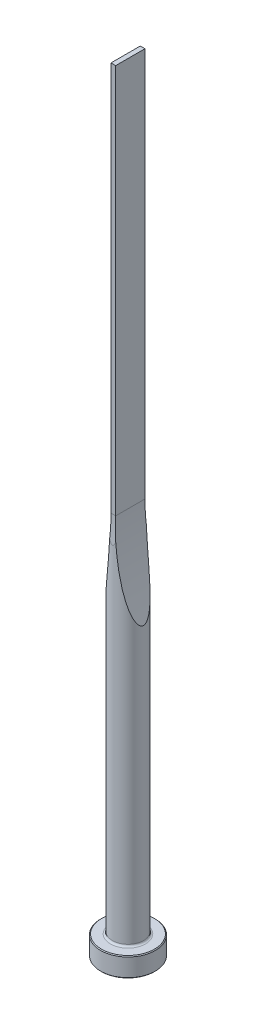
ISO-10303-21;
HEADER;
FILE_DESCRIPTION(('STEP AP214'),'2;1');
FILE_NAME('part.step','',(''),(''),'','','');
FILE_SCHEMA(('AUTOMOTIVE_DESIGN { 1 0 10303 214 1 1 1 1 }'));
ENDSEC;
DATA;
#1=APPLICATION_CONTEXT('core data for automotive mechanical design processes');
#2=APPLICATION_PROTOCOL_DEFINITION('international standard','automotive_design',2000,#1);
#3=PRODUCT_CONTEXT('',#1,'mechanical');
#4=PRODUCT('Part','Part','',(#3));
#5=PRODUCT_RELATED_PRODUCT_CATEGORY('part','',(#4));
#6=PRODUCT_DEFINITION_FORMATION('','',#4);
#7=PRODUCT_DEFINITION_CONTEXT('part definition',#1,'design');
#8=PRODUCT_DEFINITION('design','',#6,#7);
#9=PRODUCT_DEFINITION_SHAPE('','',#8);
#10=(LENGTH_UNIT() NAMED_UNIT(*) SI_UNIT(.MILLI.,.METRE.));
#11=(NAMED_UNIT(*) PLANE_ANGLE_UNIT() SI_UNIT($,.RADIAN.));
#12=(NAMED_UNIT(*) SI_UNIT($,.STERADIAN.) SOLID_ANGLE_UNIT());
#13=UNCERTAINTY_MEASURE_WITH_UNIT(LENGTH_MEASURE(1.E-05),#10,'distance_accuracy_value','');
#14=(GEOMETRIC_REPRESENTATION_CONTEXT(3) GLOBAL_UNCERTAINTY_ASSIGNED_CONTEXT((#13)) GLOBAL_UNIT_ASSIGNED_CONTEXT((#10,
#11,#12)) REPRESENTATION_CONTEXT('',''));
#15=CARTESIAN_POINT('',(0.,0.,0.));
#16=DIRECTION('',(0.,0.,1.));
#17=DIRECTION('',(1.,0.,0.));
#18=AXIS2_PLACEMENT_3D('',#15,#16,#17);
#19=CARTESIAN_POINT('',(0.,0.,0.));
#20=DIRECTION('',(0.,1.,0.));
#21=DIRECTION('',(-1.,0.,0.));
#22=AXIS2_PLACEMENT_3D('',#19,#20,#21);
#23=PLANE('',#22);
#24=CARTESIAN_POINT('',(0.,0.,0.));
#25=DIRECTION('',(0.,1.,0.));
#26=DIRECTION('',(-1.,0.,0.));
#27=AXIS2_PLACEMENT_3D('',#24,#25,#26);
#28=CIRCLE('',#27,6.8);
#29=CARTESIAN_POINT('',(-6.8,0.,0.));
#30=VERTEX_POINT('',#29);
#31=EDGE_CURVE('E133',#30,#30,#28,.T.);
#32=ORIENTED_EDGE('',*,*,#31,.F.);
#33=EDGE_LOOP('',(#32));
#34=FACE_BOUND('',#33,.T.);
#35=ADVANCED_FACE('F32',(#34),#23,.F.);
#36=CARTESIAN_POINT('',(0.,0.,0.));
#37=DIRECTION('',(0.,1.,0.));
#38=DIRECTION('',(-1.,0.,0.));
#39=AXIS2_PLACEMENT_3D('',#36,#37,#38);
#40=CONICAL_SURFACE('',#39,6.8,0.785398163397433);
#41=CARTESIAN_POINT('',(0.,0.200000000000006,0.));
#42=DIRECTION('',(0.,1.,0.));
#43=DIRECTION('',(-1.,0.,0.));
#44=AXIS2_PLACEMENT_3D('',#41,#42,#43);
#45=CIRCLE('',#44,7.);
#46=CARTESIAN_POINT('',(-7.,0.200000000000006,0.));
#47=VERTEX_POINT('',#46);
#48=EDGE_CURVE('E130',#47,#47,#45,.T.);
#49=ORIENTED_EDGE('',*,*,#48,.F.);
#50=EDGE_LOOP('',(#49));
#51=FACE_BOUND('',#50,.T.);
#52=ORIENTED_EDGE('',*,*,#31,.T.);
#53=EDGE_LOOP('',(#52));
#54=FACE_BOUND('',#53,.T.);
#55=ADVANCED_FACE('F171',(#51,#54),#40,.T.);
#56=CARTESIAN_POINT('',(0.,200.,0.));
#57=DIRECTION('',(0.,1.,0.));
#58=DIRECTION('',(-1.,0.,0.));
#59=AXIS2_PLACEMENT_3D('',#56,#57,#58);
#60=CYLINDRICAL_SURFACE('',#59,7.);
#61=CARTESIAN_POINT('',(0.,4.8,0.));
#62=DIRECTION('',(0.,1.,0.));
#63=DIRECTION('',(-1.,0.,0.));
#64=AXIS2_PLACEMENT_3D('',#61,#62,#63);
#65=CIRCLE('',#64,7.);
#66=CARTESIAN_POINT('',(-7.,4.8,0.));
#67=VERTEX_POINT('',#66);
#68=EDGE_CURVE('E127',#67,#67,#65,.T.);
#69=ORIENTED_EDGE('',*,*,#68,.F.);
#70=EDGE_LOOP('',(#69));
#71=FACE_BOUND('',#70,.T.);
#72=ORIENTED_EDGE('',*,*,#48,.T.);
#73=EDGE_LOOP('',(#72));
#74=FACE_BOUND('',#73,.T.);
#75=ADVANCED_FACE('F176',(#71,#74),#60,.T.);
#76=CARTESIAN_POINT('',(0.,4.8,0.));
#77=DIRECTION('',(0.,-1.,0.));
#78=DIRECTION('',(1.,0.,0.));
#79=AXIS2_PLACEMENT_3D('',#76,#77,#78);
#80=CONICAL_SURFACE('',#79,7.,0.785398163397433);
#81=CARTESIAN_POINT('',(0.,5.,0.));
#82=DIRECTION('',(0.,1.,0.));
#83=DIRECTION('',(-1.,0.,0.));
#84=AXIS2_PLACEMENT_3D('',#81,#82,#83);
#85=CIRCLE('',#84,6.8);
#86=CARTESIAN_POINT('',(-6.8,5.,0.));
#87=VERTEX_POINT('',#86);
#88=EDGE_CURVE('E124',#87,#87,#85,.T.);
#89=ORIENTED_EDGE('',*,*,#88,.F.);
#90=EDGE_LOOP('',(#89));
#91=FACE_BOUND('',#90,.T.);
#92=ORIENTED_EDGE('',*,*,#68,.T.);
#93=EDGE_LOOP('',(#92));
#94=FACE_BOUND('',#93,.T.);
#95=ADVANCED_FACE('F183',(#91,#94),#80,.T.);
#96=CARTESIAN_POINT('',(6.8,5.,0.));
#97=DIRECTION('',(0.,-1.,0.));
#98=DIRECTION('',(1.,0.,0.));
#99=AXIS2_PLACEMENT_3D('',#96,#97,#98);
#100=PLANE('',#99);
#101=CARTESIAN_POINT('',(0.,5.,0.));
#102=DIRECTION('',(0.,1.,0.));
#103=DIRECTION('',(-1.,0.,0.));
#104=AXIS2_PLACEMENT_3D('',#101,#102,#103);
#105=CIRCLE('',#104,4.50000000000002);
#106=CARTESIAN_POINT('',(-4.50000000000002,5.,0.));
#107=VERTEX_POINT('',#106);
#108=EDGE_CURVE('E121',#107,#107,#105,.T.);
#109=ORIENTED_EDGE('',*,*,#108,.F.);
#110=EDGE_LOOP('',(#109));
#111=FACE_BOUND('',#110,.T.);
#112=ORIENTED_EDGE('',*,*,#88,.T.);
#113=EDGE_LOOP('',(#112));
#114=FACE_BOUND('',#113,.T.);
#115=ADVANCED_FACE('F190',(#111,#114),#100,.F.);
#116=CARTESIAN_POINT('',(0.,5.5,0.));
#117=DIRECTION('',(0.,1.,0.));
#118=DIRECTION('',(-1.,0.,0.));
#119=AXIS2_PLACEMENT_3D('',#116,#117,#118);
#120=TOROIDAL_SURFACE('',#119,4.50000000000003,0.5);
#121=CARTESIAN_POINT('',(0.,5.50000000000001,0.));
#122=DIRECTION('',(0.,1.,0.));
#123=DIRECTION('',(-1.,0.,0.));
#124=AXIS2_PLACEMENT_3D('',#121,#122,#123);
#125=CIRCLE('',#124,4.00000000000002);
#126=CARTESIAN_POINT('',(-4.00000000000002,5.50000000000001,0.));
#127=VERTEX_POINT('',#126);
#128=EDGE_CURVE('E112',#127,#127,#125,.T.);
#129=ORIENTED_EDGE('',*,*,#128,.F.);
#130=EDGE_LOOP('',(#129));
#131=FACE_BOUND('',#130,.T.);
#132=ORIENTED_EDGE('',*,*,#108,.T.);
#133=EDGE_LOOP('',(#132));
#134=FACE_BOUND('',#133,.T.);
#135=ADVANCED_FACE('F168',(#131,#134),#120,.F.);
#136=CARTESIAN_POINT('',(0.,200.,0.));
#137=DIRECTION('',(0.,1.,0.));
#138=DIRECTION('',(-1.,0.,0.));
#139=AXIS2_PLACEMENT_3D('',#136,#137,#138);
#140=CYLINDRICAL_SURFACE('',#139,4.00000000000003);
#141=CARTESIAN_POINT('',(4.00000000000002,75.4961227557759,0.));
#142=CARTESIAN_POINT('',(3.99999564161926,75.4961377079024,0.072413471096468));
#143=CARTESIAN_POINT('',(3.99800322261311,75.5031762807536,0.14492468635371));
#144=CARTESIAN_POINT('',(3.99031322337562,75.530379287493,0.287279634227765));
#145=CARTESIAN_POINT('',(3.98460601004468,75.5505778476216,0.357115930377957));
#146=CARTESIAN_POINT('',(3.96856971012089,75.6074534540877,0.507306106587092));
#147=CARTESIAN_POINT('',(3.95749573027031,75.646793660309,0.586551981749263));
#148=CARTESIAN_POINT('',(3.93217275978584,75.7370671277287,0.737506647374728));
#149=CARTESIAN_POINT('',(3.91791778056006,75.7880222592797,0.809200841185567));
#150=CARTESIAN_POINT('',(3.88934869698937,75.8905537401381,0.936273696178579));
#151=CARTESIAN_POINT('',(3.87530210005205,75.9411185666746,0.992548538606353));
#152=CARTESIAN_POINT('',(3.84606514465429,76.0467582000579,1.1004129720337));
#153=CARTESIAN_POINT('',(3.83087387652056,76.1018365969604,1.15199876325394));
#154=CARTESIAN_POINT('',(3.79965336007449,76.2154818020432,1.25113546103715));
#155=CARTESIAN_POINT('',(3.78362230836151,76.2740561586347,1.29867705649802));
#156=CARTESIAN_POINT('',(3.75099135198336,76.3937815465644,1.39011393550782));
#157=CARTESIAN_POINT('',(3.73439162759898,76.4549317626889,1.43401035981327));
#158=CARTESIAN_POINT('',(3.6930241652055,76.6079842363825,1.53818457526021));
#159=CARTESIAN_POINT('',(3.66802493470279,76.7010453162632,1.59666444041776));
#160=CARTESIAN_POINT('',(3.61751018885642,76.8903465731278,1.70802585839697));
#161=CARTESIAN_POINT('',(3.59199442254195,76.9865883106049,1.76090460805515));
#162=CARTESIAN_POINT('',(3.54064570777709,77.1816080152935,1.86200096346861));
#163=CARTESIAN_POINT('',(3.51481230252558,77.2803899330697,1.91021067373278));
#164=CARTESIAN_POINT('',(3.46302756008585,77.4798165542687,2.00255699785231));
#165=CARTESIAN_POINT('',(3.43707620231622,77.5804615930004,2.04669286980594));
#166=CARTESIAN_POINT('',(3.35898443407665,77.8855399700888,2.17422236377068));
#167=CARTESIAN_POINT('',(3.30684459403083,78.0922129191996,2.25228414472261));
#168=CARTESIAN_POINT('',(3.22913547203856,78.4050098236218,2.36106736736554));
#169=CARTESIAN_POINT('',(3.20332878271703,78.5096864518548,2.39592801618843));
#170=CARTESIAN_POINT('',(3.15191115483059,78.7198812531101,2.46317944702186));
#171=CARTESIAN_POINT('',(3.12630021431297,78.8253994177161,2.49557025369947));
#172=CARTESIAN_POINT('',(3.05370800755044,79.1268778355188,2.58465377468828));
#173=CARTESIAN_POINT('',(3.00701123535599,79.3236961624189,2.63867658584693));
#174=CARTESIAN_POINT('',(2.91459477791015,79.7191969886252,2.7404109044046));
#175=CARTESIAN_POINT('',(2.8688752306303,79.9178797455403,2.78812152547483));
#176=CARTESIAN_POINT('',(2.7785142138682,80.3167970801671,2.8781817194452));
#177=CARTESIAN_POINT('',(2.73387326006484,80.517032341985,2.92052876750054));
#178=CARTESIAN_POINT('',(2.64577308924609,80.918693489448,3.00056953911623));
#179=CARTESIAN_POINT('',(2.60231393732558,81.1201194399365,3.03826300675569));
#180=CARTESIAN_POINT('',(2.4736142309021,81.7267618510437,3.14543682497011));
#181=CARTESIAN_POINT('',(2.39025159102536,82.1334599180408,3.20881732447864));
#182=CARTESIAN_POINT('',(2.22888225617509,82.949528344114,3.32292076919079));
#183=CARTESIAN_POINT('',(2.15087426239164,83.3588980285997,3.37364679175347));
#184=CARTESIAN_POINT('',(2.00010529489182,84.1812134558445,3.46516661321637));
#185=CARTESIAN_POINT('',(1.92736389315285,84.5941667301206,3.50592458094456));
#186=CARTESIAN_POINT('',(1.78755023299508,85.4217659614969,3.57922983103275));
#187=CARTESIAN_POINT('',(1.72047824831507,85.8364119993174,3.61177671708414));
#188=CARTESIAN_POINT('',(1.59216998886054,86.6664957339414,3.67014347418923));
#189=CARTESIAN_POINT('',(1.53092595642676,87.0819316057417,3.69597236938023));
#190=CARTESIAN_POINT('',(1.41422203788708,87.9139140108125,3.74217950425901));
#191=CARTESIAN_POINT('',(1.35876219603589,88.3304605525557,3.7625577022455));
#192=CARTESIAN_POINT('',(1.23052997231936,89.3480416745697,3.80686626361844));
#193=CARTESIAN_POINT('',(1.16088260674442,89.94957573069,3.82841184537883));
#194=CARTESIAN_POINT('',(1.03372424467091,91.1541488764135,3.86468251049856));
#195=CARTESIAN_POINT('',(0.976213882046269,91.7571880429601,3.87940723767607));
#196=CARTESIAN_POINT('',(0.8733630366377,92.9645352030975,3.9038482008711));
#197=CARTESIAN_POINT('',(0.828025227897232,93.5688434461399,3.91356333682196));
#198=CARTESIAN_POINT('',(0.749563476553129,94.7782873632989,3.92934517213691));
#199=CARTESIAN_POINT('',(0.716439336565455,95.3834230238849,3.9354119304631));
#200=CARTESIAN_POINT('',(0.662359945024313,96.5956185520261,3.94487439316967));
#201=CARTESIAN_POINT('',(0.641432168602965,97.2026796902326,3.94826407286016));
#202=CARTESIAN_POINT('',(0.611870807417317,98.4171113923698,3.95295302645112));
#203=CARTESIAN_POINT('',(0.603237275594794,99.0244819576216,3.9542522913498));
#204=CARTESIAN_POINT('',(0.598268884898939,100.23916519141,3.95500702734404));
#205=CARTESIAN_POINT('',(0.601931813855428,100.846477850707,3.95446283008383));
#206=CARTESIAN_POINT('',(0.621549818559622,102.060898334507,3.9514269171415));
#207=CARTESIAN_POINT('',(0.637504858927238,102.668006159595,3.94893520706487));
#208=CARTESIAN_POINT('',(0.681565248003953,103.878067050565,3.94156883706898));
#209=CARTESIAN_POINT('',(0.709596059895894,104.481022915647,3.93670877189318));
#210=CARTESIAN_POINT('',(0.777780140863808,105.686220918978,3.92380724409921));
#211=CARTESIAN_POINT('',(0.817933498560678,106.288463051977,3.91576575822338));
#212=CARTESIAN_POINT('',(0.910362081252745,107.49222316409,3.89531575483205));
#213=CARTESIAN_POINT('',(0.962642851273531,108.093740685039,3.88290523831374));
#214=CARTESIAN_POINT('',(1.07928092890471,109.295443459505,3.85211559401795));
#215=CARTESIAN_POINT('',(1.1436379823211,109.895628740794,3.83373659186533));
#216=CARTESIAN_POINT('',(1.28415058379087,111.09237790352,3.78898225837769));
#217=CARTESIAN_POINT('',(1.36026767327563,111.688947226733,3.76263273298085));
#218=CARTESIAN_POINT('',(1.52436736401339,112.879948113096,3.69919550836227));
#219=CARTESIAN_POINT('',(1.61235107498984,113.474379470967,3.66210680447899));
#220=CARTESIAN_POINT('',(1.79995345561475,114.659858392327,3.57365007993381));
#221=CARTESIAN_POINT('',(1.89956189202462,115.250908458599,3.52229456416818));
#222=CARTESIAN_POINT('',(2.05751784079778,116.134385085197,3.43078434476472));
#223=CARTESIAN_POINT('',(2.11158852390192,116.428334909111,3.39787168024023));
#224=CARTESIAN_POINT('',(2.22252257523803,117.015010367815,3.32637407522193));
#225=CARTESIAN_POINT('',(2.27938579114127,117.307736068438,3.28778944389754));
#226=CARTESIAN_POINT('',(2.37335149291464,117.778974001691,3.22011433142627));
#227=CARTESIAN_POINT('',(2.40960878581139,117.957955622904,3.19310843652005));
#228=CARTESIAN_POINT('',(2.48312261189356,118.315271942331,3.13628169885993));
#229=CARTESIAN_POINT('',(2.52037916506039,118.493606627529,3.10646079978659));
#230=CARTESIAN_POINT('',(2.59587928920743,118.849611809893,3.04365297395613));
#231=CARTESIAN_POINT('',(2.6341233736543,119.027281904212,3.01066437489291));
#232=CARTESIAN_POINT('',(2.71153832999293,119.381723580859,2.94113375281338));
#233=CARTESIAN_POINT('',(2.75070919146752,119.558495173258,2.90459176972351));
#234=CARTESIAN_POINT('',(2.830034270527,119.911452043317,2.82736273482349));
#235=CARTESIAN_POINT('',(2.87019091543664,120.08763433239,2.78666446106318));
#236=CARTESIAN_POINT('',(2.95130772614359,120.438668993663,2.70060749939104));
#237=CARTESIAN_POINT('',(2.99226785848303,120.613521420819,2.65524900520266));
#238=CARTESIAN_POINT('',(3.07485965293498,120.961434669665,2.55915064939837));
#239=CARTESIAN_POINT('',(3.11649075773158,121.134496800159,2.50841507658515));
#240=CARTESIAN_POINT('',(3.20030527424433,121.478470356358,2.4005652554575));
#241=CARTESIAN_POINT('',(3.2424886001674,121.649382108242,2.34345198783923));
#242=CARTESIAN_POINT('',(3.32761650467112,121.990047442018,2.22094497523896));
#243=CARTESIAN_POINT('',(3.37056449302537,122.159773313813,2.15547565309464));
#244=CARTESIAN_POINT('',(3.45650933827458,122.495378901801,2.01478368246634));
#245=CARTESIAN_POINT('',(3.49950619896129,122.661254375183,1.93955082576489));
#246=CARTESIAN_POINT('',(3.58466359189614,122.986063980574,1.77724053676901));
#247=CARTESIAN_POINT('',(3.62682777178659,123.145036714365,1.69024459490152));
#248=CARTESIAN_POINT('',(3.68879218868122,123.376234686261,1.54772713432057));
#249=CARTESIAN_POINT('',(3.7092153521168,123.45202482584,1.49826783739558));
#250=CARTESIAN_POINT('',(3.74941531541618,123.60046270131,1.39462493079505));
#251=CARTESIAN_POINT('',(3.76919236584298,123.673111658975,1.34044318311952));
#252=CARTESIAN_POINT('',(3.81294137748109,123.833065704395,1.21132384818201));
#253=CARTESIAN_POINT('',(3.83662600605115,123.919114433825,1.13470379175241));
#254=CARTESIAN_POINT('',(3.88140503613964,124.080952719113,0.970527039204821));
#255=CARTESIAN_POINT('',(3.90250393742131,124.156760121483,0.88298989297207));
#256=CARTESIAN_POINT('',(3.93398752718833,124.26941489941,0.726495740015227));
#257=CARTESIAN_POINT('',(3.94559651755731,124.310816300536,0.661104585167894));
#258=CARTESIAN_POINT('',(3.96605720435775,124.383629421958,0.524532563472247));
#259=CARTESIAN_POINT('',(3.97491309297,124.415056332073,0.453360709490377));
#260=CARTESIAN_POINT('',(3.98768281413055,124.460314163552,0.319456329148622));
#261=CARTESIAN_POINT('',(3.99220018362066,124.47629734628,0.25751952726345));
#262=CARTESIAN_POINT('',(3.99832424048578,124.497956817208,0.131735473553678));
#263=CARTESIAN_POINT('',(3.99993382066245,124.503643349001,0.0678901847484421));
#264=CARTESIAN_POINT('',(4.00006223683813,124.504097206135,-0.0599473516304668));
#265=CARTESIAN_POINT('',(3.99857607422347,124.498846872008,-0.123939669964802));
#266=CARTESIAN_POINT('',(3.99267617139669,124.477981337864,-0.25007580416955));
#267=CARTESIAN_POINT('',(3.98825964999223,124.462356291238,-0.312217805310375));
#268=CARTESIAN_POINT('',(3.97527309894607,124.416334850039,-0.450974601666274));
#269=CARTESIAN_POINT('',(3.96586622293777,124.382955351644,-0.526508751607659));
#270=CARTESIAN_POINT('',(3.94398370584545,124.305070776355,-0.671103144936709));
#271=CARTESIAN_POINT('',(3.93150139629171,124.260541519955,-0.740148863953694));
#272=CARTESIAN_POINT('',(3.90656010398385,124.171249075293,-0.861383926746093));
#273=CARTESIAN_POINT('',(3.89441124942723,124.127642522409,-0.914510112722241));
#274=CARTESIAN_POINT('',(3.86899878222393,124.036132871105,-1.01667208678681));
#275=CARTESIAN_POINT('',(3.85573433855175,123.988226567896,-1.06570477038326));
#276=CARTESIAN_POINT('',(3.82836739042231,123.889044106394,-1.16018395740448));
#277=CARTESIAN_POINT('',(3.81426309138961,123.837760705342,-1.2056222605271));
#278=CARTESIAN_POINT('',(3.7854632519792,123.732660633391,-1.29320936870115));
#279=CARTESIAN_POINT('',(3.77076787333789,123.678844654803,-1.33535906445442));
#280=CARTESIAN_POINT('',(3.73512522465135,123.547818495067,-1.43264720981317));
#281=CARTESIAN_POINT('',(3.71397435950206,123.469668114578,-1.48644230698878));
#282=CARTESIAN_POINT('',(3.67112376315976,123.31045464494,-1.58932194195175));
#283=CARTESIAN_POINT('',(3.64942378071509,123.229390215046,-1.6384042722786));
#284=CARTESIAN_POINT('',(3.58375426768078,122.982643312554,-1.77976912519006));
#285=CARTESIAN_POINT('',(3.53927682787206,122.813633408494,-1.8660091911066));
#286=CARTESIAN_POINT('',(3.44977897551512,122.469331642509,-2.02668892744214));
#287=CARTESIAN_POINT('',(3.40475697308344,122.294013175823,-2.10106902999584));
#288=CARTESIAN_POINT('',(3.31494343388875,121.939741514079,-2.24008593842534));
#289=CARTESIAN_POINT('',(3.27015171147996,121.760792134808,-2.3047324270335));
#290=CARTESIAN_POINT('',(3.18612289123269,121.42057968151,-2.41931179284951));
#291=CARTESIAN_POINT('',(3.14683114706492,121.2596084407,-2.47008185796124));
#292=CARTESIAN_POINT('',(3.06878971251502,120.935972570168,-2.56639084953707));
#293=CARTESIAN_POINT('',(3.0300400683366,120.773307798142,-2.6119293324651));
#294=CARTESIAN_POINT('',(2.91473222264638,120.283156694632,-2.74186435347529));
#295=CARTESIAN_POINT('',(2.83914992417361,119.953654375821,-2.8195346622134));
#296=CARTESIAN_POINT('',(2.69097804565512,119.290403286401,-2.96126843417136));
#297=CARTESIAN_POINT('',(2.61839496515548,118.956647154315,-3.02530347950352));
#298=CARTESIAN_POINT('',(2.4766639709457,118.28646942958,-3.14238445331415));
#299=CARTESIAN_POINT('',(2.40751642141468,117.950047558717,-3.19542921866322));
#300=CARTESIAN_POINT('',(2.27265074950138,117.274214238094,-3.29271652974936));
#301=CARTESIAN_POINT('',(2.20694335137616,116.934796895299,-3.3369326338));
#302=CARTESIAN_POINT('',(2.07929343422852,116.254363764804,-3.41793037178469));
#303=CARTESIAN_POINT('',(2.01735109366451,115.91334790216,-3.45471165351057));
#304=CARTESIAN_POINT('',(1.89739134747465,115.230470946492,-3.5220205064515));
#305=CARTESIAN_POINT('',(1.83936902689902,114.888611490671,-3.55255600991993));
#306=CARTESIAN_POINT('',(1.727217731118,114.203835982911,-3.608411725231));
#307=CARTESIAN_POINT('',(1.67308875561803,113.860919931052,-3.63373193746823));
#308=CARTESIAN_POINT('',(1.53321874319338,112.940225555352,-3.69573828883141));
#309=CARTESIAN_POINT('',(1.45106925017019,112.361627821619,-3.7284130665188));
#310=CARTESIAN_POINT('',(1.29800476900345,111.202476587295,-3.78441543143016));
#311=CARTESIAN_POINT('',(1.22709062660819,110.621922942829,-3.80774231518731));
#312=CARTESIAN_POINT('',(1.09655325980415,109.459143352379,-3.84736572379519));
#313=CARTESIAN_POINT('',(1.03693331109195,108.876916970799,-3.86366021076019));
#314=CARTESIAN_POINT('',(0.929055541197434,107.711309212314,-3.89100856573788));
#315=CARTESIAN_POINT('',(0.880797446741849,107.127927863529,-3.90206255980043));
#316=CARTESIAN_POINT('',(0.795592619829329,105.959221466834,-3.92032303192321));
#317=CARTESIAN_POINT('',(0.758666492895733,105.373894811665,-3.92752251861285));
#318=CARTESIAN_POINT('',(0.696262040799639,104.202601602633,-3.93906396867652));
#319=CARTESIAN_POINT('',(0.670783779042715,103.616635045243,-3.94340591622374));
#320=CARTESIAN_POINT('',(0.631290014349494,102.444400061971,-3.94992062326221));
#321=CARTESIAN_POINT('',(0.61727264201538,101.858131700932,-3.95209373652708));
#322=CARTESIAN_POINT('',(0.600699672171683,100.685430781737,-3.95464664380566));
#323=CARTESIAN_POINT('',(0.598144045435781,100.098998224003,-3.95502644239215));
#324=CARTESIAN_POINT('',(0.604484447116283,98.9282455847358,-3.95406229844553));
#325=CARTESIAN_POINT('',(0.613340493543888,98.3439252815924,-3.95272437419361));
#326=CARTESIAN_POINT('',(0.642431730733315,97.1755736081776,-3.94810065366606));
#327=CARTESIAN_POINT('',(0.662666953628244,96.5915422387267,-3.94481485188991));
#328=CARTESIAN_POINT('',(0.714512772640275,95.4238908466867,-3.93575467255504));
#329=CARTESIAN_POINT('',(0.746125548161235,94.8402709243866,-3.92997981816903));
#330=CARTESIAN_POINT('',(0.820710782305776,93.6738024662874,-3.91508384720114));
#331=CARTESIAN_POINT('',(0.863683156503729,93.0909539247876,-3.90596275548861));
#332=CARTESIAN_POINT('',(0.960884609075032,91.9272467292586,-3.88319332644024));
#333=CARTESIAN_POINT('',(1.0150950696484,91.3463863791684,-3.86955245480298));
#334=CARTESIAN_POINT('',(1.13478238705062,90.1859765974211,-3.83616145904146));
#335=CARTESIAN_POINT('',(1.20025961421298,89.6064272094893,-3.81641113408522));
#336=CARTESIAN_POINT('',(1.34239625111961,88.4492480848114,-3.76876527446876));
#337=CARTESIAN_POINT('',(1.41905154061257,87.8716177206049,-3.74087273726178));
#338=CARTESIAN_POINT('',(1.58346740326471,86.7185860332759,-3.67430628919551));
#339=CARTESIAN_POINT('',(1.67122682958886,86.1431844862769,-3.6356334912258));
#340=CARTESIAN_POINT('',(1.78780397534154,85.425534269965,-3.5783270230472));
#341=CARTESIAN_POINT('',(1.81149456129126,85.2818994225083,-3.56640112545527));
#342=CARTESIAN_POINT('',(1.85955822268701,84.9948285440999,-3.54157829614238));
#343=CARTESIAN_POINT('',(1.88393129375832,84.85139251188,-3.52868137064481));
#344=CARTESIAN_POINT('',(1.95806984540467,84.4213981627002,-3.48842778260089));
#345=CARTESIAN_POINT('',(2.00885380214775,84.135158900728,-3.45950872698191));
#346=CARTESIAN_POINT('',(2.11307968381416,83.5637829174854,-3.3968506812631));
#347=CARTESIAN_POINT('',(2.16652076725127,83.2786458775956,-3.36311321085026));
#348=CARTESIAN_POINT('',(2.27601482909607,82.7096094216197,-3.28999715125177));
#349=CARTESIAN_POINT('',(2.33206772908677,82.4257099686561,-3.25061873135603));
#350=CARTESIAN_POINT('',(2.46860643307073,81.7512532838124,-3.14893656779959));
#351=CARTESIAN_POINT('',(2.55024834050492,81.3613673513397,-3.08362075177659));
#352=CARTESIAN_POINT('',(2.67606846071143,80.7796556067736,-2.97350542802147));
#353=CARTESIAN_POINT('',(2.71855977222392,80.5863071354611,-2.9347851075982));
#354=CARTESIAN_POINT('',(2.80459946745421,80.2008426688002,-2.85267651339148));
#355=CARTESIAN_POINT('',(2.84814781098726,80.0087266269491,-2.80928841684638));
#356=CARTESIAN_POINT('',(2.95374235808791,79.5498445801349,-2.69877172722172));
#357=CARTESIAN_POINT('',(3.01625290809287,79.2837977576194,-2.62906697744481));
#358=CARTESIAN_POINT('',(3.14290843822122,78.7554491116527,-2.47629605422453));
#359=CARTESIAN_POINT('',(3.20705554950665,78.4931529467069,-2.39321162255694));
#360=CARTESIAN_POINT('',(3.30572146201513,78.0972866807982,-2.25292733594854));
#361=CARTESIAN_POINT('',(3.33993028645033,77.9614070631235,-2.20202594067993));
#362=CARTESIAN_POINT('',(3.40842047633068,77.6919800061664,-2.09445657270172));
#363=CARTESIAN_POINT('',(3.44270182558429,77.5584320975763,-2.03778977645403));
#364=CARTESIAN_POINT('',(3.51102218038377,77.2947484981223,-1.91767763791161));
#365=CARTESIAN_POINT('',(3.54506157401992,77.164605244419,-1.85424925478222));
#366=CARTESIAN_POINT('',(3.61259911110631,76.9086691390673,-1.71896967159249));
#367=CARTESIAN_POINT('',(3.64609760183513,76.7828734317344,-1.64712414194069));
#368=CARTESIAN_POINT('',(3.70554577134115,76.5614784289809,-1.50780992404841));
#369=CARTESIAN_POINT('',(3.73169584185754,76.4647668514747,-1.4422104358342));
#370=CARTESIAN_POINT('',(3.78277813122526,76.2770269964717,-1.30236256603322));
#371=CARTESIAN_POINT('',(3.80770778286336,76.1860105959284,-1.22809697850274));
#372=CARTESIAN_POINT('',(3.8556765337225,76.0118658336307,-1.06810478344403));
#373=CARTESIAN_POINT('',(3.87869011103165,75.928842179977,-0.982254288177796));
#374=CARTESIAN_POINT('',(3.92082845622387,75.777544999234,-0.797495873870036));
#375=CARTESIAN_POINT('',(3.93996853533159,75.7092133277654,-0.698642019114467));
#376=CARTESIAN_POINT('',(3.96488637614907,75.6205363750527,-0.53236392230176));
#377=CARTESIAN_POINT('',(3.97287767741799,75.5921680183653,-0.469585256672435));
#378=CARTESIAN_POINT('',(3.98603728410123,75.5455105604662,-0.34015099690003));
#379=CARTESIAN_POINT('',(3.99121331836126,75.5271938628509,-0.27350657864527));
#380=CARTESIAN_POINT('',(3.99645206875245,75.5086643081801,-0.171843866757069));
#381=CARTESIAN_POINT('',(3.997777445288,75.5039786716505,-0.137668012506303));
#382=CARTESIAN_POINT('',(3.99955257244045,75.4977038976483,-0.0690022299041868));
#383=CARTESIAN_POINT('',(4.00000207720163,75.4961156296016,-0.0345122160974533));
#384=CARTESIAN_POINT('',(4.00000000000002,75.4961227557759,0.));
#385=B_SPLINE_CURVE_WITH_KNOTS('',3,(#141,#142,#143,#144,#145,#146,#147,#148,#149,#150,#151,
#152,#153,#154,#155,#156,#157,#158,#159,#160,#161,#162,#163,#164,#165,#166,#167,#168,#169,#170,
#171,#172,#173,#174,#175,#176,#177,#178,#179,#180,#181,#182,#183,#184,#185,#186,#187,#188,#189,
#190,#191,#192,#193,#194,#195,#196,#197,#198,#199,#200,#201,#202,#203,#204,#205,#206,#207,#208,
#209,#210,#211,#212,#213,#214,#215,#216,#217,#218,#219,#220,#221,#222,#223,#224,#225,#226,#227,
#228,#229,#230,#231,#232,#233,#234,#235,#236,#237,#238,#239,#240,#241,#242,#243,#244,#245,#246,
#247,#248,#249,#250,#251,#252,#253,#254,#255,#256,#257,#258,#259,#260,#261,#262,#263,#264,#265,
#266,#267,#268,#269,#270,#271,#272,#273,#274,#275,#276,#277,#278,#279,#280,#281,#282,#283,#284,
#285,#286,#287,#288,#289,#290,#291,#292,#293,#294,#295,#296,#297,#298,#299,#300,#301,#302,#303,
#304,#305,#306,#307,#308,#309,#310,#311,#312,#313,#314,#315,#316,#317,#318,#319,#320,#321,#322,
#323,#324,#325,#326,#327,#328,#329,#330,#331,#332,#333,#334,#335,#336,#337,#338,#339,#340,#341,
#342,#343,#344,#345,#346,#347,#348,#349,#350,#351,#352,#353,#354,#355,#356,#357,#358,#359,#360,
#361,#362,#363,#364,#365,#366,#367,#368,#369,#370,#371,#372,#373,#374,#375,#376,#377,#378,#379,
#380,#381,#382,#383,#384),.UNSPECIFIED.,.T.,.F.,(4,2,2,2,2,2,2,2,2,2,2,2,2,2,2,2,2,2,2,2,2,2,2,
2,2,2,2,2,2,2,2,2,2,2,2,2,2,2,2,2,2,2,2,2,2,2,2,2,2,2,2,2,2,2,2,2,2,2,2,2,2,2,2,2,2,2,2,2,2,2,2,
2,2,2,2,2,2,2,2,2,2,2,2,2,2,2,2,2,2,2,2,2,2,2,2,2,2,2,2,2,2,2,2,2,2,2,2,2,2,2,2,2,2,2,2,2,2,2,2,
2,2,4),(0.,0.217071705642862,0.43470857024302,0.700672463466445,0.96714135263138,
1.19765545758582,1.42835472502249,1.65957152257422,1.89071568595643,2.22861679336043,
2.56668621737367,2.90531769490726,3.24401072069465,3.92450632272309,4.26441084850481,
4.60431197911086,5.23228898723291,5.86035407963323,6.48871373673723,7.11710793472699,
8.37667122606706,9.63592791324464,10.8996467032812,12.1634264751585,13.4254997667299,
14.6875827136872,16.5052028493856,18.3229178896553,20.1410319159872,21.9591165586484,
23.7812811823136,25.6034536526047,27.4252983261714,29.247137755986,31.0578896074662,
32.8686546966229,34.6802493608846,36.4918058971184,38.2975588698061,40.103480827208,
41.9078248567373,42.8098366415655,43.7117992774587,44.265587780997,44.8193873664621,
45.373480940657,45.9275682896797,46.4831933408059,47.038795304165,47.5939574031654,
48.1490342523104,48.7095441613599,49.2706449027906,49.8280406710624,50.1062328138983,
50.3843157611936,50.7365369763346,51.0881362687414,51.3222456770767,51.5559968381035,
51.747552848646,51.9389181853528,52.1305927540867,52.3224495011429,52.570400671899,
52.8188942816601,53.027986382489,53.2372356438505,53.4469492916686,53.6566059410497,
53.948007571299,54.2395450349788,54.823468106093,55.4102374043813,55.9964190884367,
56.5162238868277,57.0360727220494,58.0762260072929,59.1185263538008,60.160936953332,
61.2064242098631,62.2519609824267,63.2961615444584,64.3403620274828,66.0960707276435,
67.8519115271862,69.6082608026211,71.3645678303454,73.1240497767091,74.883541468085,
76.6427461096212,78.4019462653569,80.1549996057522,81.908057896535,83.6614521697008,
85.4148334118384,87.1653327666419,88.9158896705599,90.6658029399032,92.4155356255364,
92.8537216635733,93.291904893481,94.168287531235,95.0443943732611,95.9204749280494,
97.1311135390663,97.7362062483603,98.3412759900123,99.1871473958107,100.034183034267,
100.481319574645,100.928365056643,101.374314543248,101.819965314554,102.178888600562,
102.538537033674,102.902391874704,103.264779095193,103.472139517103,103.678927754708,
103.782354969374,103.885811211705),.UNSPECIFIED.);
#386=CARTESIAN_POINT('',(0.774335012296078,94.4009010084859,-3.92433501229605));
#387=VERTEX_POINT('',#386);
#388=CARTESIAN_POINT('',(0.774335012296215,94.4009010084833,3.92433501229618));
#389=VERTEX_POINT('',#388);
#390=EDGE_CURVE('E138',#387,#389,#385,.T.);
#391=ORIENTED_EDGE('',*,*,#390,.T.);
#392=CARTESIAN_POINT('',(-1.39194109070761,100.,3.74999999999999));
#393=CARTESIAN_POINT('',(-1.39194449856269,100.334099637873,3.75000007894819));
#394=CARTESIAN_POINT('',(-1.38695792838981,100.668209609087,3.75186098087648));
#395=CARTESIAN_POINT('',(-1.36667392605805,101.336077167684,3.75929815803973));
#396=CARTESIAN_POINT('',(-1.35137656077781,101.669834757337,3.76487440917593));
#397=CARTESIAN_POINT('',(-1.30923320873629,102.337406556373,3.7797366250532));
#398=CARTESIAN_POINT('',(-1.28235776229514,102.671218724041,3.78903204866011));
#399=CARTESIAN_POINT('',(-1.21470251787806,103.337193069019,3.81127649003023));
#400=CARTESIAN_POINT('',(-1.17393087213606,103.669356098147,3.82422336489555));
#401=CARTESIAN_POINT('',(-1.09844611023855,104.165763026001,3.84630718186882));
#402=CARTESIAN_POINT('',(-1.07085040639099,104.331144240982,3.85412453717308));
#403=CARTESIAN_POINT('',(-1.00961852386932,104.660899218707,3.87061811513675));
#404=CARTESIAN_POINT('',(-0.975977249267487,104.825272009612,3.87929505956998));
#405=CARTESIAN_POINT('',(-0.900897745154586,105.151793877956,3.89742276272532));
#406=CARTESIAN_POINT('',(-0.859480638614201,105.313947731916,3.90687138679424));
#407=CARTESIAN_POINT('',(-0.78876888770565,105.554515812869,3.92153114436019));
#408=CARTESIAN_POINT('',(-0.763786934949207,105.634208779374,3.92649537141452));
#409=CARTESIAN_POINT('',(-0.710141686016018,105.792326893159,3.93655330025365));
#410=CARTESIAN_POINT('',(-0.681479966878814,105.870752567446,3.94164694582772));
#411=CARTESIAN_POINT('',(-0.619110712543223,106.025914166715,3.95192410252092));
#412=CARTESIAN_POINT('',(-0.585384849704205,106.102642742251,3.95710787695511));
#413=CARTESIAN_POINT('',(-0.510918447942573,106.252489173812,3.9674185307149));
#414=CARTESIAN_POINT('',(-0.470205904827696,106.32561999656,3.97254555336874));
#415=CARTESIAN_POINT('',(-0.405871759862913,106.421768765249,3.97939443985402));
#416=CARTESIAN_POINT('',(-0.387100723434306,106.447990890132,3.98127456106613));
#417=CARTESIAN_POINT('',(-0.34734030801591,106.498838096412,3.98494137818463));
#418=CARTESIAN_POINT('',(-0.326345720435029,106.523459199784,3.98672783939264));
#419=CARTESIAN_POINT('',(-0.281381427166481,106.570454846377,3.99015550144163));
#420=CARTESIAN_POINT('',(-0.257378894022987,106.592798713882,3.99179469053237));
#421=CARTESIAN_POINT('',(-0.206002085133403,106.633234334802,3.99477391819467));
#422=CARTESIAN_POINT('',(-0.17864389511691,106.651345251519,3.99611530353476));
#423=CARTESIAN_POINT('',(-0.133196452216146,106.674230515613,3.99781497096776));
#424=CARTESIAN_POINT('',(-0.11631594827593,106.681368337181,3.99834625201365));
#425=CARTESIAN_POINT('',(-0.0816311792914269,106.692886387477,3.99920443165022));
#426=CARTESIAN_POINT('',(-0.0638281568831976,106.697270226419,3.99953159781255));
#427=CARTESIAN_POINT('',(-0.0275781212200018,106.702824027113,3.99994619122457));
#428=CARTESIAN_POINT('',(-0.00912739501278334,106.703970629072,4.00003187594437));
#429=CARTESIAN_POINT('',(0.0276703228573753,106.702829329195,3.99994663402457));
#430=CARTESIAN_POINT('',(0.0460172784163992,106.700540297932,3.99977562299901));
#431=CARTESIAN_POINT('',(0.0805943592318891,106.693127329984,3.99922251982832));
#432=CARTESIAN_POINT('',(0.0968774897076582,106.688240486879,3.99885808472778));
#433=CARTESIAN_POINT('',(0.128581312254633,106.67623584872,3.99796430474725));
#434=CARTESIAN_POINT('',(0.144001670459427,106.669117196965,3.99743489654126));
#435=CARTESIAN_POINT('',(0.185006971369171,106.647151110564,3.99580470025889));
#436=CARTESIAN_POINT('',(0.209611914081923,106.630495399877,3.99457196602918));
#437=CARTESIAN_POINT('',(0.256071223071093,106.593720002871,3.99186273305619));
#438=CARTESIAN_POINT('',(0.277915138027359,106.573587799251,3.99038535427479));
#439=CARTESIAN_POINT('',(0.350665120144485,106.499085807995,3.98494736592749));
#440=CARTESIAN_POINT('',(0.39555281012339,106.438989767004,3.98061079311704));
#441=CARTESIAN_POINT('',(0.476792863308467,106.313343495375,3.97168524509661));
#442=CARTESIAN_POINT('',(0.513090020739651,106.247761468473,3.96709485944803));
#443=CARTESIAN_POINT('',(0.605299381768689,106.063175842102,3.95438947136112));
#444=CARTESIAN_POINT('',(0.655314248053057,105.941243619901,3.94623160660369));
#445=CARTESIAN_POINT('',(0.745376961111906,105.693666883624,3.93019294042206));
#446=CARTESIAN_POINT('',(0.785397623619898,105.568013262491,3.9223129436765));
#447=CARTESIAN_POINT('',(0.858576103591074,105.314360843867,3.90694950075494));
#448=CARTESIAN_POINT('',(0.891716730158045,105.186357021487,3.89946708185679));
#449=CARTESIAN_POINT('',(0.952763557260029,104.9292949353,3.8849977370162));
#450=CARTESIAN_POINT('',(0.980676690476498,104.800238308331,3.87801016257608));
#451=CARTESIAN_POINT('',(1.05809609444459,104.413067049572,3.85789047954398));
#452=CARTESIAN_POINT('',(1.10161068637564,104.153715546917,3.84552636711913));
#453=CARTESIAN_POINT('',(1.1773991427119,103.633248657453,3.82298810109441));
#454=CARTESIAN_POINT('',(1.20966805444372,103.372132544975,3.81281491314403));
#455=CARTESIAN_POINT('',(1.26533785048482,102.848421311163,3.79470411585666));
#456=CARTESIAN_POINT('',(1.28872293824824,102.585824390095,3.78677049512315));
#457=CARTESIAN_POINT('',(1.32794213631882,102.0599951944,3.77319404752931));
#458=CARTESIAN_POINT('',(1.34377550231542,101.796762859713,3.76755144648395));
#459=CARTESIAN_POINT('',(1.36866096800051,101.270393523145,3.75858225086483));
#460=CARTESIAN_POINT('',(1.3777246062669,101.007257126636,3.75525171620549));
#461=CARTESIAN_POINT('',(1.38952938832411,100.48082294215,3.7508994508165));
#462=CARTESIAN_POINT('',(1.39227046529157,100.217525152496,3.74987774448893));
#463=CARTESIAN_POINT('',(1.39154941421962,99.6912325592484,3.75014538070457));
#464=CARTESIAN_POINT('',(1.38809419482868,99.4282377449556,3.75143214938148));
#465=CARTESIAN_POINT('',(1.37484398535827,98.9024375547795,3.75630869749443));
#466=CARTESIAN_POINT('',(1.3650492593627,98.6396321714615,3.75989838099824));
#467=CARTESIAN_POINT('',(1.33880225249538,98.117044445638,3.76932382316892));
#468=CARTESIAN_POINT('',(1.32241801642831,97.857258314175,3.77513659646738));
#469=CARTESIAN_POINT('',(1.28217391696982,97.338202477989,3.78899593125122));
#470=CARTESIAN_POINT('',(1.25831091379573,97.0789330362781,3.79704343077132));
#471=CARTESIAN_POINT('',(1.20163024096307,96.5608244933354,3.81536023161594));
#472=CARTESIAN_POINT('',(1.16879164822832,96.3019878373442,3.82563471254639));
#473=CARTESIAN_POINT('',(1.09180587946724,95.786236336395,3.84832767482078));
#474=CARTESIAN_POINT('',(1.04766828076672,95.5293200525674,3.86074433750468));
#475=CARTESIAN_POINT('',(0.969147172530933,95.1457963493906,3.88091053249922));
#476=CARTESIAN_POINT('',(0.940826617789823,95.0179166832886,3.88791072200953));
#477=CARTESIAN_POINT('',(0.878848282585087,94.7632801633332,3.90238986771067));
#478=CARTESIAN_POINT('',(0.845183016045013,94.6365251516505,3.90986948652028));
#479=CARTESIAN_POINT('',(0.770839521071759,94.3854811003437,3.92521002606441));
#480=CARTESIAN_POINT('',(0.730184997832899,94.261185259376,3.93306959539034));
#481=CARTESIAN_POINT('',(0.661250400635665,94.0778844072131,3.94503185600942));
#482=CARTESIAN_POINT('',(0.636977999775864,94.0173732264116,3.94904355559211));
#483=CARTESIAN_POINT('',(0.584962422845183,93.8978769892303,3.95708454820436));
#484=CARTESIAN_POINT('',(0.557221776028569,93.838890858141,3.9611138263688));
#485=CARTESIAN_POINT('',(0.496796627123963,93.7229032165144,3.96914753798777));
#486=CARTESIAN_POINT('',(0.464075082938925,93.665920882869,3.97315152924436));
#487=CARTESIAN_POINT('',(0.391808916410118,93.5565882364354,3.98093309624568));
#488=CARTESIAN_POINT('',(0.352311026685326,93.504209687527,3.98471199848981));
#489=CARTESIAN_POINT('',(0.291384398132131,93.4398387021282,3.9894040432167));
#490=CARTESIAN_POINT('',(0.274626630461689,93.4235001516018,3.99059997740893));
#491=CARTESIAN_POINT('',(0.239433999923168,93.3926348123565,3.9928667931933));
#492=CARTESIAN_POINT('',(0.220996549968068,93.3781109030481,3.99393747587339));
#493=CARTESIAN_POINT('',(0.18203801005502,93.3515121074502,3.99590377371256));
#494=CARTESIAN_POINT('',(0.161493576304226,93.3394704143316,3.99679701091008));
#495=CARTESIAN_POINT('',(0.118575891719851,93.3192603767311,3.99829905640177));
#496=CARTESIAN_POINT('',(0.0962092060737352,93.3110787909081,3.99890883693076));
#497=CARTESIAN_POINT('',(0.056541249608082,93.3013407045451,3.99963520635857));
#498=CARTESIAN_POINT('',(0.0395386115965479,93.2985809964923,3.99984131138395));
#499=CARTESIAN_POINT('',(0.00530985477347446,93.2960145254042,4.00003297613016));
#500=CARTESIAN_POINT('',(-0.0119161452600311,93.2962062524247,4.00001864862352));
#501=CARTESIAN_POINT('',(-0.0460423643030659,93.2995172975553,3.99977139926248));
#502=CARTESIAN_POINT('',(-0.0629431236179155,93.3026312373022,3.99953887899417));
#503=CARTESIAN_POINT('',(-0.0960472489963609,93.3114519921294,3.99888109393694));
#504=CARTESIAN_POINT('',(-0.112249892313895,93.3171614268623,3.99845563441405));
#505=CARTESIAN_POINT('',(-0.151566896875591,93.334081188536,3.99719710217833));
#506=CARTESIAN_POINT('',(-0.17410372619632,93.3466149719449,3.99626655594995));
#507=CARTESIAN_POINT('',(-0.216979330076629,93.374976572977,3.9941686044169));
#508=CARTESIAN_POINT('',(-0.237311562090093,93.3908138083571,3.99300052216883));
#509=CARTESIAN_POINT('',(-0.293164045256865,93.4396828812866,3.98941150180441));
#510=CARTESIAN_POINT('',(-0.326182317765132,93.4755180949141,3.98679738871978));
#511=CARTESIAN_POINT('',(-0.387204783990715,93.5511526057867,3.98133154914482));
#512=CARTESIAN_POINT('',(-0.415192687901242,93.5909641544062,3.97847909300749));
#513=CARTESIAN_POINT('',(-0.48540204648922,93.7007934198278,3.97068874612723));
#514=CARTESIAN_POINT('',(-0.524314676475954,93.7728961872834,3.96565520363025));
#515=CARTESIAN_POINT('',(-0.595699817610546,93.9202694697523,3.95555476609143));
#516=CARTESIAN_POINT('',(-0.628155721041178,93.9955475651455,3.95048781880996));
#517=CARTESIAN_POINT('',(-0.688605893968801,94.1483373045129,3.94040179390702));
#518=CARTESIAN_POINT('',(-0.716575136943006,94.2258588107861,3.93538312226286));
#519=CARTESIAN_POINT('',(-0.768950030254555,94.3819705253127,3.92548292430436));
#520=CARTESIAN_POINT('',(-0.793360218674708,94.4605592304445,3.92060122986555));
#521=CARTESIAN_POINT('',(-0.867663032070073,94.7152944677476,3.90511794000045));
#522=CARTESIAN_POINT('',(-0.912146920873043,94.8930332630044,3.89483400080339));
#523=CARTESIAN_POINT('',(-0.992112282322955,95.2506061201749,3.8752237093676));
#524=CARTESIAN_POINT('',(-1.02758760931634,95.4304415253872,3.86589801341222));
#525=CARTESIAN_POINT('',(-1.09180429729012,95.7917615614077,3.84825637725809));
#526=CARTESIAN_POINT('',(-1.12053061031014,95.9732489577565,3.8399427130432));
#527=CARTESIAN_POINT('',(-1.1725161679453,96.3370581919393,3.82438612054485));
#528=CARTESIAN_POINT('',(-1.19577469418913,96.519380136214,3.81714333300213));
#529=CARTESIAN_POINT('',(-1.25866381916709,97.0667778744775,3.79707123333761));
#530=CARTESIAN_POINT('',(-1.29147691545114,97.4327013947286,3.78587783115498));
#531=CARTESIAN_POINT('',(-1.34282300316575,98.1651770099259,3.76795987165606));
#532=CARTESIAN_POINT('',(-1.36137252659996,98.5317278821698,3.76123014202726));
#533=CARTESIAN_POINT('',(-1.37978686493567,99.0820898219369,3.75449366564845));
#534=CARTESIAN_POINT('',(-1.38435657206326,99.2657354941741,3.75280785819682));
#535=CARTESIAN_POINT('',(-1.3904313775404,99.6329197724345,3.75056150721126));
#536=CARTESIAN_POINT('',(-1.39193921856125,99.8164583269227,3.74999995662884));
#537=CARTESIAN_POINT('',(-1.39194109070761,100.,3.74999999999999));
#538=B_SPLINE_CURVE_WITH_KNOTS('',3,(#392,#393,#394,#395,#396,#397,#398,#399,#400,#401,#402,
#403,#404,#405,#406,#407,#408,#409,#410,#411,#412,#413,#414,#415,#416,#417,#418,#419,#420,#421,
#422,#423,#424,#425,#426,#427,#428,#429,#430,#431,#432,#433,#434,#435,#436,#437,#438,#439,#440,
#441,#442,#443,#444,#445,#446,#447,#448,#449,#450,#451,#452,#453,#454,#455,#456,#457,#458,#459,
#460,#461,#462,#463,#464,#465,#466,#467,#468,#469,#470,#471,#472,#473,#474,#475,#476,#477,#478,
#479,#480,#481,#482,#483,#484,#485,#486,#487,#488,#489,#490,#491,#492,#493,#494,#495,#496,#497,
#498,#499,#500,#501,#502,#503,#504,#505,#506,#507,#508,#509,#510,#511,#512,#513,#514,#515,#516,
#517,#518,#519,#520,#521,#522,#523,#524,#525,#526,#527,#528,#529,#530,#531,#532,#533,#534,#535,
#536,#537),.UNSPECIFIED.,.T.,.F.,(4,2,2,2,2,2,2,2,2,2,2,2,2,2,2,2,2,2,2,2,2,2,2,2,2,2,2,2,2,2,2,
2,2,2,2,2,2,2,2,2,2,2,2,2,2,2,2,2,2,2,2,2,2,2,2,2,2,2,2,2,2,2,2,2,2,2,2,2,2,2,2,2,4),(0.,
1.00227413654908,2.00454177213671,3.00937481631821,4.01361938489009,4.51708131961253,
5.02096963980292,5.52350845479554,5.77444116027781,6.02526668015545,6.27702287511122,
6.52779287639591,6.62462106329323,6.72168130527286,6.81991213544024,6.91768924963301,
6.97250700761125,7.02725275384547,7.08239254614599,7.13755046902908,7.18837076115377,
7.23921058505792,7.32790198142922,7.41691964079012,7.64058495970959,7.86565080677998,
8.26074626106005,8.65690494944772,9.05404189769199,9.4506483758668,10.2400274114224,
11.0297536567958,11.8208776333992,12.6120795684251,13.4019298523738,14.1917884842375,
14.9807669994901,15.7697126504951,16.5507124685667,17.3320406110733,18.1152058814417,
18.8977095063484,19.2911173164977,19.6850810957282,20.0777341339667,20.2736272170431,
20.4693782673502,20.6666634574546,20.8626390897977,20.9328478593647,21.0031666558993,
21.0743722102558,21.1453316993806,21.1967759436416,21.2481938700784,21.2995173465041,
21.3508927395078,21.4278600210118,21.5050498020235,21.6506217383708,21.796656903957,
22.0422774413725,22.288521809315,22.5360952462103,22.7833501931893,23.3334505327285,
23.8839251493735,24.4356157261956,24.9873787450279,26.0896404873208,27.1906227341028,
27.7417280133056,28.2923394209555),.UNSPECIFIED.);
#539=CARTESIAN_POINT('',(-0.774335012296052,94.4009010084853,3.92433501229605));
#540=VERTEX_POINT('',#539);
#541=EDGE_CURVE('E104',#389,#540,#538,.T.);
#542=ORIENTED_EDGE('',*,*,#541,.T.);
#543=CARTESIAN_POINT('',(-4.00000000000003,75.4961227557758,0.));
#544=CARTESIAN_POINT('',(-3.99999564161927,75.4961377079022,-0.0724134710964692));
#545=CARTESIAN_POINT('',(-3.99800322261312,75.5031762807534,-0.144924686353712));
#546=CARTESIAN_POINT('',(-3.99031322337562,75.5303792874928,-0.287279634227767));
#547=CARTESIAN_POINT('',(-3.98460601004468,75.5505778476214,-0.357115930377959));
#548=CARTESIAN_POINT('',(-3.96856971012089,75.6074534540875,-0.507306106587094));
#549=CARTESIAN_POINT('',(-3.95749573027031,75.6467936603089,-0.586551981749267));
#550=CARTESIAN_POINT('',(-3.93217275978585,75.7370671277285,-0.737506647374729));
#551=CARTESIAN_POINT('',(-3.91791778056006,75.7880222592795,-0.809200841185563));
#552=CARTESIAN_POINT('',(-3.88934869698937,75.8905537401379,-0.936273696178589));
#553=CARTESIAN_POINT('',(-3.87530210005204,75.9411185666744,-0.99254853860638));
#554=CARTESIAN_POINT('',(-3.84606514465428,76.0467582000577,-1.10041297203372));
#555=CARTESIAN_POINT('',(-3.83087387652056,76.1018365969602,-1.15199876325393));
#556=CARTESIAN_POINT('',(-3.7996533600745,76.215481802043,-1.25113546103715));
#557=CARTESIAN_POINT('',(-3.78362230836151,76.2740561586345,-1.29867705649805));
#558=CARTESIAN_POINT('',(-3.75099135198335,76.3937815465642,-1.39011393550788));
#559=CARTESIAN_POINT('',(-3.73439162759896,76.4549317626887,-1.43401035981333));
#560=CARTESIAN_POINT('',(-3.69302416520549,76.6079842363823,-1.53818457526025));
#561=CARTESIAN_POINT('',(-3.66802493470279,76.7010453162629,-1.59666444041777));
#562=CARTESIAN_POINT('',(-3.61751018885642,76.8903465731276,-1.70802585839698));
#563=CARTESIAN_POINT('',(-3.59199442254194,76.9865883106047,-1.76090460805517));
#564=CARTESIAN_POINT('',(-3.54064570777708,77.1816080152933,-1.86200096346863));
#565=CARTESIAN_POINT('',(-3.51481230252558,77.2803899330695,-1.91021067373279));
#566=CARTESIAN_POINT('',(-3.46302756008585,77.4798165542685,-2.00255699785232));
#567=CARTESIAN_POINT('',(-3.43707620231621,77.5804615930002,-2.04669286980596));
#568=CARTESIAN_POINT('',(-3.35898443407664,77.8855399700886,-2.17422236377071));
#569=CARTESIAN_POINT('',(-3.30684459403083,78.0922129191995,-2.25228414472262));
#570=CARTESIAN_POINT('',(-3.22913547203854,78.4050098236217,-2.36106736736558));
#571=CARTESIAN_POINT('',(-3.203328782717,78.5096864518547,-2.39592801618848));
#572=CARTESIAN_POINT('',(-3.15191115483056,78.71988125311,-2.46317944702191));
#573=CARTESIAN_POINT('',(-3.12630021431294,78.825399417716,-2.49557025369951));
#574=CARTESIAN_POINT('',(-3.05370800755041,79.1268778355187,-2.58465377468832));
#575=CARTESIAN_POINT('',(-3.00701123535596,79.3236961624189,-2.63867658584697));
#576=CARTESIAN_POINT('',(-2.91459477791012,79.7191969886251,-2.74041090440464));
#577=CARTESIAN_POINT('',(-2.86887523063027,79.9178797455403,-2.78812152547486));
#578=CARTESIAN_POINT('',(-2.77851421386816,80.3167970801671,-2.87818171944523));
#579=CARTESIAN_POINT('',(-2.73387326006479,80.517032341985,-2.92052876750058));
#580=CARTESIAN_POINT('',(-2.64577308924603,80.918693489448,-3.00056953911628));
#581=CARTESIAN_POINT('',(-2.60231393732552,81.1201194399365,-3.03826300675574));
#582=CARTESIAN_POINT('',(-2.47361423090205,81.7267618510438,-3.14543682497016));
#583=CARTESIAN_POINT('',(-2.39025159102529,82.1334599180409,-3.20881732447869));
#584=CARTESIAN_POINT('',(-2.22888225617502,82.9495283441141,-3.32292076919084));
#585=CARTESIAN_POINT('',(-2.15087426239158,83.3588980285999,-3.37364679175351));
#586=CARTESIAN_POINT('',(-2.00010529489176,84.1812134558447,-3.46516661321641));
#587=CARTESIAN_POINT('',(-1.92736389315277,84.5941667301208,-3.5059245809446));
#588=CARTESIAN_POINT('',(-1.78755023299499,85.4217659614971,-3.5792298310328));
#589=CARTESIAN_POINT('',(-1.72047824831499,85.8364119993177,-3.61177671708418));
#590=CARTESIAN_POINT('',(-1.59216998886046,86.6664957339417,-3.67014347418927));
#591=CARTESIAN_POINT('',(-1.53092595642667,87.081931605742,-3.69597236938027));
#592=CARTESIAN_POINT('',(-1.41422203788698,87.9139140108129,-3.74217950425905));
#593=CARTESIAN_POINT('',(-1.35876219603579,88.330460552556,-3.76255770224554));
#594=CARTESIAN_POINT('',(-1.23052997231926,89.3480416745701,-3.80686626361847));
#595=CARTESIAN_POINT('',(-1.16088260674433,89.9495757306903,-3.82841184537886));
#596=CARTESIAN_POINT('',(-1.03372424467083,91.1541488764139,-3.86468251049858));
#597=CARTESIAN_POINT('',(-0.976213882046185,91.7571880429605,-3.87940723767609));
#598=CARTESIAN_POINT('',(-0.87336303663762,92.9645352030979,-3.90384820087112));
#599=CARTESIAN_POINT('',(-0.82802522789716,93.5688434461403,-3.91356333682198));
#600=CARTESIAN_POINT('',(-0.749563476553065,94.7782873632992,-3.92934517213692));
#601=CARTESIAN_POINT('',(-0.71643933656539,95.3834230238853,-3.93541193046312));
#602=CARTESIAN_POINT('',(-0.662359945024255,96.5956185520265,-3.94487439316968));
#603=CARTESIAN_POINT('',(-0.641432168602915,97.202679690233,-3.94826407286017));
#604=CARTESIAN_POINT('',(-0.611870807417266,98.4171113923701,-3.95295302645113));
#605=CARTESIAN_POINT('',(-0.603237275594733,99.0244819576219,-3.95425229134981));
#606=CARTESIAN_POINT('',(-0.598268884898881,100.239165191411,-3.95500702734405));
#607=CARTESIAN_POINT('',(-0.601931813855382,100.846477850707,-3.95446283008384));
#608=CARTESIAN_POINT('',(-0.621549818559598,102.060898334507,-3.95142691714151));
#609=CARTESIAN_POINT('',(-0.637504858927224,102.668006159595,-3.94893520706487));
#610=CARTESIAN_POINT('',(-0.681565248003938,103.878067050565,-3.94156883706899));
#611=CARTESIAN_POINT('',(-0.709596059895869,104.481022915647,-3.93670877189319));
#612=CARTESIAN_POINT('',(-0.777780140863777,105.686220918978,-3.92380724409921));
#613=CARTESIAN_POINT('',(-0.817933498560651,106.288463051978,-3.91576575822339));
#614=CARTESIAN_POINT('',(-0.910362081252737,107.49222316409,-3.89531575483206));
#615=CARTESIAN_POINT('',(-0.962642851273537,108.09374068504,-3.88290523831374));
#616=CARTESIAN_POINT('',(-1.07928092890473,109.295443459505,-3.85211559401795));
#617=CARTESIAN_POINT('',(-1.14363798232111,109.895628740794,-3.83373659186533));
#618=CARTESIAN_POINT('',(-1.28415058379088,111.092377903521,-3.78898225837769));
#619=CARTESIAN_POINT('',(-1.36026767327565,111.688947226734,-3.76263273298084));
#620=CARTESIAN_POINT('',(-1.52436736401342,112.879948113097,-3.69919550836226));
#621=CARTESIAN_POINT('',(-1.61235107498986,113.474379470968,-3.66210680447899));
#622=CARTESIAN_POINT('',(-1.79995345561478,114.659858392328,-3.57365007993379));
#623=CARTESIAN_POINT('',(-1.89956189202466,115.250908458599,-3.52229456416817));
#624=CARTESIAN_POINT('',(-2.05751784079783,116.134385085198,-3.4307843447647));
#625=CARTESIAN_POINT('',(-2.11158852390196,116.428334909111,-3.39787168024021));
#626=CARTESIAN_POINT('',(-2.22252257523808,117.015010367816,-3.3263740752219));
#627=CARTESIAN_POINT('',(-2.27938579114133,117.307736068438,-3.28778944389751));
#628=CARTESIAN_POINT('',(-2.37335149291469,117.778974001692,-3.22011433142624));
#629=CARTESIAN_POINT('',(-2.40960878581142,117.957955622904,-3.19310843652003));
#630=CARTESIAN_POINT('',(-2.48312261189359,118.315271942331,-3.13628169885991));
#631=CARTESIAN_POINT('',(-2.52037916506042,118.49360662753,-3.10646079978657));
#632=CARTESIAN_POINT('',(-2.59587928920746,118.849611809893,-3.04365297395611));
#633=CARTESIAN_POINT('',(-2.63412337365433,119.027281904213,-3.01066437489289));
#634=CARTESIAN_POINT('',(-2.71153832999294,119.381723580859,-2.94113375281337));
#635=CARTESIAN_POINT('',(-2.75070919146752,119.558495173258,-2.90459176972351));
#636=CARTESIAN_POINT('',(-2.830034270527,119.911452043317,-2.8273627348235));
#637=CARTESIAN_POINT('',(-2.87019091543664,120.087634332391,-2.78666446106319));
#638=CARTESIAN_POINT('',(-2.95130772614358,120.438668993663,-2.70060749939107));
#639=CARTESIAN_POINT('',(-2.992267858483,120.613521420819,-2.6552490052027));
#640=CARTESIAN_POINT('',(-3.07485965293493,120.961434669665,-2.55915064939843));
#641=CARTESIAN_POINT('',(-3.11649075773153,121.134496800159,-2.50841507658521));
#642=CARTESIAN_POINT('',(-3.20030527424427,121.478470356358,-2.40056525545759));
#643=CARTESIAN_POINT('',(-3.24248860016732,121.649382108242,-2.34345198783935));
#644=CARTESIAN_POINT('',(-3.32761650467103,121.990047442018,-2.2209449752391));
#645=CARTESIAN_POINT('',(-3.37056449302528,122.159773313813,-2.15547565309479));
#646=CARTESIAN_POINT('',(-3.45650933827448,122.495378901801,-2.01478368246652));
#647=CARTESIAN_POINT('',(-3.49950619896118,122.661254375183,-1.9395508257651));
#648=CARTESIAN_POINT('',(-3.58466359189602,122.986063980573,-1.77724053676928));
#649=CARTESIAN_POINT('',(-3.62682777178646,123.145036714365,-1.69024459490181));
#650=CARTESIAN_POINT('',(-3.68879218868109,123.376234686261,-1.54772713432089));
#651=CARTESIAN_POINT('',(-3.70921535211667,123.45202482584,-1.49826783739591));
#652=CARTESIAN_POINT('',(-3.74941531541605,123.600462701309,-1.39462493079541));
#653=CARTESIAN_POINT('',(-3.76919236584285,123.673111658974,-1.3404431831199));
#654=CARTESIAN_POINT('',(-3.81294137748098,123.833065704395,-1.21132384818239));
#655=CARTESIAN_POINT('',(-3.83662600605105,123.919114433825,-1.13470379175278));
#656=CARTESIAN_POINT('',(-3.88140503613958,124.080952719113,-0.970527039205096));
#657=CARTESIAN_POINT('',(-3.90250393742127,124.156760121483,-0.882989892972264));
#658=CARTESIAN_POINT('',(-3.93398752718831,124.26941489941,-0.726495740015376));
#659=CARTESIAN_POINT('',(-3.94559651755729,124.310816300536,-0.661104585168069));
#660=CARTESIAN_POINT('',(-3.96605720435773,124.383629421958,-0.524532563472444));
#661=CARTESIAN_POINT('',(-3.97491309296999,124.415056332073,-0.453360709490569));
#662=CARTESIAN_POINT('',(-3.98768281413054,124.460314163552,-0.319456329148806));
#663=CARTESIAN_POINT('',(-3.99220018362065,124.47629734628,-0.25751952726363));
#664=CARTESIAN_POINT('',(-3.99832424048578,124.497956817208,-0.131735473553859));
#665=CARTESIAN_POINT('',(-3.99993382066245,124.503643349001,-0.0678901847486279));
#666=CARTESIAN_POINT('',(-4.00006223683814,124.504097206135,0.0599473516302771));
#667=CARTESIAN_POINT('',(-3.99857607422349,124.498846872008,0.123939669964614));
#668=CARTESIAN_POINT('',(-3.99267617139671,124.477981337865,0.250075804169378));
#669=CARTESIAN_POINT('',(-3.98825964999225,124.462356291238,0.312217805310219));
#670=CARTESIAN_POINT('',(-3.9752730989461,124.416334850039,0.450974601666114));
#671=CARTESIAN_POINT('',(-3.9658662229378,124.382955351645,0.526508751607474));
#672=CARTESIAN_POINT('',(-3.94398370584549,124.305070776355,0.671103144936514));
#673=CARTESIAN_POINT('',(-3.93150139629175,124.260541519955,0.740148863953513));
#674=CARTESIAN_POINT('',(-3.9065601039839,124.171249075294,0.861383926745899));
#675=CARTESIAN_POINT('',(-3.89441124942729,124.127642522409,0.914510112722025));
#676=CARTESIAN_POINT('',(-3.868998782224,124.036132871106,1.01667208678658));
#677=CARTESIAN_POINT('',(-3.85573433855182,123.988226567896,1.06570477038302));
#678=CARTESIAN_POINT('',(-3.82836739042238,123.889044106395,1.16018395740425));
#679=CARTESIAN_POINT('',(-3.81426309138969,123.837760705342,1.20562226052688));
#680=CARTESIAN_POINT('',(-3.78546325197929,123.732660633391,1.2932093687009));
#681=CARTESIAN_POINT('',(-3.770767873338,123.678844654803,1.33535906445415));
#682=CARTESIAN_POINT('',(-3.73512522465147,123.547818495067,1.43264720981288));
#683=CARTESIAN_POINT('',(-3.71397435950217,123.469668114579,1.48644230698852));
#684=CARTESIAN_POINT('',(-3.67112376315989,123.31045464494,1.58932194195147));
#685=CARTESIAN_POINT('',(-3.64942378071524,123.229390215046,1.63840427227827));
#686=CARTESIAN_POINT('',(-3.58375426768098,122.982643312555,1.77976912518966));
#687=CARTESIAN_POINT('',(-3.53927682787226,122.813633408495,1.86600919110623));
#688=CARTESIAN_POINT('',(-3.44977897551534,122.46933164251,2.02668892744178));
#689=CARTESIAN_POINT('',(-3.40475697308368,122.294013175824,2.10106902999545));
#690=CARTESIAN_POINT('',(-3.31494343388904,121.93974151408,2.24008593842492));
#691=CARTESIAN_POINT('',(-3.27015171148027,121.76079213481,2.30473242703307));
#692=CARTESIAN_POINT('',(-3.18612289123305,121.420579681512,2.41931179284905));
#693=CARTESIAN_POINT('',(-3.14683114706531,121.259608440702,2.47008185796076));
#694=CARTESIAN_POINT('',(-3.06878971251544,120.93597257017,2.56639084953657));
#695=CARTESIAN_POINT('',(-3.03004006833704,120.773307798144,2.6119293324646));
#696=CARTESIAN_POINT('',(-2.91473222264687,120.283156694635,2.74186435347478));
#697=CARTESIAN_POINT('',(-2.83914992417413,119.953654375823,2.81953466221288));
#698=CARTESIAN_POINT('',(-2.6909780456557,119.290403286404,2.96126843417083));
#699=CARTESIAN_POINT('',(-2.61839496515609,118.956647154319,3.025303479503));
#700=CARTESIAN_POINT('',(-2.47666397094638,118.286469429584,3.14238445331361));
#701=CARTESIAN_POINT('',(-2.40751642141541,117.95004755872,3.19542921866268));
#702=CARTESIAN_POINT('',(-2.27265074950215,117.274214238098,3.29271652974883));
#703=CARTESIAN_POINT('',(-2.20694335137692,116.934796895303,3.33693263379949));
#704=CARTESIAN_POINT('',(-2.07929343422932,116.254363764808,3.41793037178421));
#705=CARTESIAN_POINT('',(-2.01735109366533,115.913347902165,3.4547116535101));
#706=CARTESIAN_POINT('',(-1.89739134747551,115.230470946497,3.52202050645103));
#707=CARTESIAN_POINT('',(-1.8393690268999,114.888611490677,3.55255600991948));
#708=CARTESIAN_POINT('',(-1.72721773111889,114.203835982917,3.60841172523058));
#709=CARTESIAN_POINT('',(-1.67308875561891,113.860919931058,3.63373193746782));
#710=CARTESIAN_POINT('',(-1.53321874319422,112.940225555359,3.69573828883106));
#711=CARTESIAN_POINT('',(-1.45106925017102,112.361627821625,3.72841306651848));
#712=CARTESIAN_POINT('',(-1.29800476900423,111.202476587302,3.7844154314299));
#713=CARTESIAN_POINT('',(-1.22709062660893,110.621922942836,3.80774231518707));
#714=CARTESIAN_POINT('',(-1.09655325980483,109.459143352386,3.847365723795));
#715=CARTESIAN_POINT('',(-1.0369333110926,108.876916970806,3.86366021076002));
#716=CARTESIAN_POINT('',(-0.92905554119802,107.711309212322,3.89100856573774));
#717=CARTESIAN_POINT('',(-0.8807974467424,107.127927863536,3.90206255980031));
#718=CARTESIAN_POINT('',(-0.795592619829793,105.959221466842,3.92032303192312));
#719=CARTESIAN_POINT('',(-0.758666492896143,105.373894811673,3.92752251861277));
#720=CARTESIAN_POINT('',(-0.696262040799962,104.20260160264,3.93906396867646));
#721=CARTESIAN_POINT('',(-0.670783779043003,103.616635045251,3.94340591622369));
#722=CARTESIAN_POINT('',(-0.631290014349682,102.444400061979,3.94992062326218));
#723=CARTESIAN_POINT('',(-0.617272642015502,101.85813170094,3.95209373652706));
#724=CARTESIAN_POINT('',(-0.600699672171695,100.685430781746,3.95464664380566));
#725=CARTESIAN_POINT('',(-0.59814404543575,100.098998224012,3.95502644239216));
#726=CARTESIAN_POINT('',(-0.604484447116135,98.9282455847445,3.95406229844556));
#727=CARTESIAN_POINT('',(-0.613340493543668,98.3439252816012,3.95272437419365));
#728=CARTESIAN_POINT('',(-0.642431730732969,97.1755736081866,3.94810065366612));
#729=CARTESIAN_POINT('',(-0.662666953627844,96.5915422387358,3.94481485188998));
#730=CARTESIAN_POINT('',(-0.714512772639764,95.4238908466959,3.93575467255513));
#731=CARTESIAN_POINT('',(-0.746125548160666,94.840270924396,3.92997981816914));
#732=CARTESIAN_POINT('',(-0.820710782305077,93.6738024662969,3.91508384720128));
#733=CARTESIAN_POINT('',(-0.863683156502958,93.0909539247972,3.90596275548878));
#734=CARTESIAN_POINT('',(-0.960884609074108,91.9272467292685,3.88319332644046));
#735=CARTESIAN_POINT('',(-1.0150950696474,91.3463863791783,3.86955245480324));
#736=CARTESIAN_POINT('',(-1.13478238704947,90.1859765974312,3.8361614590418));
#737=CARTESIAN_POINT('',(-1.20025961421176,89.6064272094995,3.8164111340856));
#738=CARTESIAN_POINT('',(-1.34239625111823,88.4492480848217,3.76876527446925));
#739=CARTESIAN_POINT('',(-1.4190515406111,87.8716177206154,3.74087273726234));
#740=CARTESIAN_POINT('',(-1.58346740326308,86.7185860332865,3.67430628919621));
#741=CARTESIAN_POINT('',(-1.67122682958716,86.1431844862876,3.63563349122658));
#742=CARTESIAN_POINT('',(-1.78780397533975,85.4255342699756,3.57832702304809));
#743=CARTESIAN_POINT('',(-1.81149456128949,85.2818994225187,3.56640112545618));
#744=CARTESIAN_POINT('',(-1.85955822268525,84.99482854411,3.54157829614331));
#745=CARTESIAN_POINT('',(-1.88393129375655,84.8513925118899,3.52868137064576));
#746=CARTESIAN_POINT('',(-1.95806984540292,84.4213981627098,3.48842778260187));
#747=CARTESIAN_POINT('',(-2.00885380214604,84.1351589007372,3.4595087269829));
#748=CARTESIAN_POINT('',(-2.11307968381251,83.5637829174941,3.39685068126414));
#749=CARTESIAN_POINT('',(-2.16652076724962,83.2786458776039,3.36311321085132));
#750=CARTESIAN_POINT('',(-2.27601482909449,82.7096094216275,3.28999715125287));
#751=CARTESIAN_POINT('',(-2.33206772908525,82.4257099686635,3.25061873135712));
#752=CARTESIAN_POINT('',(-2.46860643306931,81.7512532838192,3.14893656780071));
#753=CARTESIAN_POINT('',(-2.55024834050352,81.3613673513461,3.08362075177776));
#754=CARTESIAN_POINT('',(-2.67606846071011,80.7796556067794,2.97350542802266));
#755=CARTESIAN_POINT('',(-2.71855977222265,80.5863071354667,2.93478510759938));
#756=CARTESIAN_POINT('',(-2.80459946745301,80.2008426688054,2.85267651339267));
#757=CARTESIAN_POINT('',(-2.84814781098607,80.008726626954,2.80928841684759));
#758=CARTESIAN_POINT('',(-2.9537423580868,79.5498445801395,2.69877172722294));
#759=CARTESIAN_POINT('',(-3.01625290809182,79.2837977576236,2.62906697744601));
#760=CARTESIAN_POINT('',(-3.14290843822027,78.7554491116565,2.47629605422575));
#761=CARTESIAN_POINT('',(-3.20705554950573,78.4931529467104,2.39321162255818));
#762=CARTESIAN_POINT('',(-3.30572146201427,78.0972866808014,2.2529273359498));
#763=CARTESIAN_POINT('',(-3.33993028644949,77.9614070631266,2.20202594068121));
#764=CARTESIAN_POINT('',(-3.40842047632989,77.6919800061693,2.09445657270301));
#765=CARTESIAN_POINT('',(-3.44270182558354,77.558432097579,2.03778977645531));
#766=CARTESIAN_POINT('',(-3.51102218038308,77.2947484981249,1.91767763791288));
#767=CARTESIAN_POINT('',(-3.54506157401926,77.1646052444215,1.8542492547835));
#768=CARTESIAN_POINT('',(-3.61259911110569,76.9086691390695,1.71896967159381));
#769=CARTESIAN_POINT('',(-3.64609760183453,76.7828734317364,1.64712414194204));
#770=CARTESIAN_POINT('',(-3.7055457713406,76.5614784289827,1.50780992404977));
#771=CARTESIAN_POINT('',(-3.73169584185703,76.4647668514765,1.44221043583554));
#772=CARTESIAN_POINT('',(-3.7827781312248,76.2770269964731,1.30236256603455));
#773=CARTESIAN_POINT('',(-3.80770778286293,76.1860105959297,1.22809697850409));
#774=CARTESIAN_POINT('',(-3.85567653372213,76.0118658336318,1.06810478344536));
#775=CARTESIAN_POINT('',(-3.87869011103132,75.928842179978,0.982254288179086));
#776=CARTESIAN_POINT('',(-3.92082845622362,75.7775449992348,0.79749587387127));
#777=CARTESIAN_POINT('',(-3.93996853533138,75.709213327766,0.698642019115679));
#778=CARTESIAN_POINT('',(-3.96488637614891,75.6205363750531,0.532363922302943));
#779=CARTESIAN_POINT('',(-3.97287767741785,75.5921680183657,0.469585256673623));
#780=CARTESIAN_POINT('',(-3.98603728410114,75.5455105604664,0.340150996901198));
#781=CARTESIAN_POINT('',(-3.99121331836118,75.527193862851,0.273506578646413));
#782=CARTESIAN_POINT('',(-3.99645206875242,75.50866430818,0.171843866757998));
#783=CARTESIAN_POINT('',(-3.99777744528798,75.5039786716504,0.137668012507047));
#784=CARTESIAN_POINT('',(-3.99955257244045,75.4977038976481,0.0690022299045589));
#785=CARTESIAN_POINT('',(-4.00000207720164,75.4961156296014,0.0345122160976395));
#786=CARTESIAN_POINT('',(-4.00000000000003,75.4961227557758,0.));
#787=B_SPLINE_CURVE_WITH_KNOTS('',3,(#543,#544,#545,#546,#547,#548,#549,#550,#551,#552,#553,
#554,#555,#556,#557,#558,#559,#560,#561,#562,#563,#564,#565,#566,#567,#568,#569,#570,#571,#572,
#573,#574,#575,#576,#577,#578,#579,#580,#581,#582,#583,#584,#585,#586,#587,#588,#589,#590,#591,
#592,#593,#594,#595,#596,#597,#598,#599,#600,#601,#602,#603,#604,#605,#606,#607,#608,#609,#610,
#611,#612,#613,#614,#615,#616,#617,#618,#619,#620,#621,#622,#623,#624,#625,#626,#627,#628,#629,
#630,#631,#632,#633,#634,#635,#636,#637,#638,#639,#640,#641,#642,#643,#644,#645,#646,#647,#648,
#649,#650,#651,#652,#653,#654,#655,#656,#657,#658,#659,#660,#661,#662,#663,#664,#665,#666,#667,
#668,#669,#670,#671,#672,#673,#674,#675,#676,#677,#678,#679,#680,#681,#682,#683,#684,#685,#686,
#687,#688,#689,#690,#691,#692,#693,#694,#695,#696,#697,#698,#699,#700,#701,#702,#703,#704,#705,
#706,#707,#708,#709,#710,#711,#712,#713,#714,#715,#716,#717,#718,#719,#720,#721,#722,#723,#724,
#725,#726,#727,#728,#729,#730,#731,#732,#733,#734,#735,#736,#737,#738,#739,#740,#741,#742,#743,
#744,#745,#746,#747,#748,#749,#750,#751,#752,#753,#754,#755,#756,#757,#758,#759,#760,#761,#762,
#763,#764,#765,#766,#767,#768,#769,#770,#771,#772,#773,#774,#775,#776,#777,#778,#779,#780,#781,
#782,#783,#784,#785,#786),.UNSPECIFIED.,.T.,.F.,(4,2,2,2,2,2,2,2,2,2,2,2,2,2,2,2,2,2,2,2,2,2,2,
2,2,2,2,2,2,2,2,2,2,2,2,2,2,2,2,2,2,2,2,2,2,2,2,2,2,2,2,2,2,2,2,2,2,2,2,2,2,2,2,2,2,2,2,2,2,2,2,
2,2,2,2,2,2,2,2,2,2,2,2,2,2,2,2,2,2,2,2,2,2,2,2,2,2,2,2,2,2,2,2,2,2,2,2,2,2,2,2,2,2,2,2,2,2,2,2,
2,2,4),(0.,0.217071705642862,0.434708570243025,0.70067246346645,0.967141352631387,
1.19765545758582,1.4283547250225,1.65957152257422,1.89071568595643,2.22861679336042,
2.56668621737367,2.90531769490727,3.24401072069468,3.92450632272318,4.26441084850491,
4.60431197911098,5.23228898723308,5.86035407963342,6.48871373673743,7.11710793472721,
8.37667122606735,9.635927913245,10.8996467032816,12.163426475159,13.4254997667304,
14.6875827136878,16.5052028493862,18.3229178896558,20.1410319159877,21.959116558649,
23.7812811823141,25.6034536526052,27.4252983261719,29.2471377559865,31.0578896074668,
32.8686546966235,34.6802493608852,36.491805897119,38.2975588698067,40.1034808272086,
41.9078248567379,42.8098366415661,43.7117992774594,44.2655877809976,44.8193873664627,
45.3734809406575,45.9275682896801,46.4831933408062,47.0387953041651,47.5939574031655,
48.1490342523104,48.7095441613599,49.2706449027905,49.8280406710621,50.106232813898,
50.3843157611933,50.7365369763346,51.0881362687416,51.3222456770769,51.5559968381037,
51.7475528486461,51.9389181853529,52.1305927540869,52.3224495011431,52.5704006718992,
52.8188942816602,53.0279863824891,53.2372356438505,53.4469492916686,53.6566059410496,
53.9480075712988,54.2395450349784,54.8234681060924,55.4102374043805,55.9964190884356,
56.5162238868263,57.0360727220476,58.0762260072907,59.118526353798,60.1609369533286,
61.2064242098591,62.2519609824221,63.2961615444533,64.3403620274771,66.0960707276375,
67.8519115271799,69.6082608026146,71.3645678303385,73.1240497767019,74.8835414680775,
76.6427461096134,78.4019462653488,80.1549996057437,81.9080578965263,83.6614521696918,
85.4148334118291,87.1653327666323,88.91588967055,90.665802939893,92.415535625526,
92.8537216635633,93.2919048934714,94.1682875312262,95.0443943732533,95.9204749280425,
97.1311135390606,97.7362062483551,98.3412759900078,99.1871473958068,100.034183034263,
100.481319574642,100.92836505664,101.374314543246,101.819965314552,102.178888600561,
102.538537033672,102.902391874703,103.264779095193,103.472139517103,103.678927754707,
103.782354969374,103.885811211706),.UNSPECIFIED.);
#788=CARTESIAN_POINT('',(-0.774335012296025,94.4009010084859,-3.92433501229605));
#789=VERTEX_POINT('',#788);
#790=EDGE_CURVE('E103',#540,#789,#787,.T.);
#791=ORIENTED_EDGE('',*,*,#790,.T.);
#792=CARTESIAN_POINT('',(0.,93.2964561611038,-4.00000000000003));
#793=CARTESIAN_POINT('',(0.0186298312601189,93.2964560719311,-4.00000000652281));
#794=CARTESIAN_POINT('',(0.0372596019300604,93.2982194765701,-3.99986824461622));
#795=CARTESIAN_POINT('',(0.0739075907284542,93.3050383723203,-3.99935933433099));
#796=CARTESIAN_POINT('',(0.0919248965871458,93.3100985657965,-3.99898183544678));
#797=CARTESIAN_POINT('',(0.131910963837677,93.3247914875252,-3.99788772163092));
#798=CARTESIAN_POINT('',(0.153544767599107,93.3353157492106,-3.99710516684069));
#799=CARTESIAN_POINT('',(0.19487446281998,93.3596165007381,-3.99530398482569));
#800=CARTESIAN_POINT('',(0.214565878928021,93.3734002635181,-3.99428482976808));
#801=CARTESIAN_POINT('',(0.266920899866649,93.4149153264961,-3.9912268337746));
#802=CARTESIAN_POINT('',(0.297607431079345,93.4450904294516,-3.98901640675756));
#803=CARTESIAN_POINT('',(0.354604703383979,93.5092628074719,-3.98435297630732));
#804=CARTESIAN_POINT('',(0.380901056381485,93.5432720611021,-3.98189921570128));
#805=CARTESIAN_POINT('',(0.444700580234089,93.6341377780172,-3.97539947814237));
#806=CARTESIAN_POINT('',(0.479736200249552,93.6927000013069,-3.97126338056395));
#807=CARTESIAN_POINT('',(0.544427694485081,93.8127619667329,-3.9629088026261));
#808=CARTESIAN_POINT('',(0.57407023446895,93.8742685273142,-3.95869014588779));
#809=CARTESIAN_POINT('',(0.629567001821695,93.9993356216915,-3.95024514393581));
#810=CARTESIAN_POINT('',(0.655400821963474,94.0629051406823,-3.94601887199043));
#811=CARTESIAN_POINT('',(0.704007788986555,94.1910985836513,-3.93763562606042));
#812=CARTESIAN_POINT('',(0.726784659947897,94.2557211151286,-3.93347857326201));
#813=CARTESIAN_POINT('',(0.794302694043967,94.4590178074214,-3.92062463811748));
#814=CARTESIAN_POINT('',(0.834873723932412,94.5990830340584,-3.9120904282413));
#815=CARTESIAN_POINT('',(0.908785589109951,94.8811646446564,-3.89557581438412));
#816=CARTESIAN_POINT('',(0.942121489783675,95.0231822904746,-3.88759579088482));
#817=CARTESIAN_POINT('',(1.0033905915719,95.3087373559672,-3.87223557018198));
#818=CARTESIAN_POINT('',(1.03131145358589,95.4522774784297,-3.86485676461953));
#819=CARTESIAN_POINT('',(1.08277797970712,95.7401781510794,-3.8507524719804));
#820=CARTESIAN_POINT('',(1.10632304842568,95.8845388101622,-3.84402707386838));
#821=CARTESIAN_POINT('',(1.17165764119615,96.3192461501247,-3.8248294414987));
#822=CARTESIAN_POINT('',(1.2079934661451,96.6104599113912,-3.81337666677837));
#823=CARTESIAN_POINT('',(1.26962889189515,97.1936661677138,-3.79329064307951));
#824=CARTESIAN_POINT('',(1.29494447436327,97.4856569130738,-3.78465331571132));
#825=CARTESIAN_POINT('',(1.33636384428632,98.0698070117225,-3.77022699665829));
#826=CARTESIAN_POINT('',(1.35248470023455,98.361965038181,-3.76443273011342));
#827=CARTESIAN_POINT('',(1.37657566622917,98.9466808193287,-3.7556889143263));
#828=CARTESIAN_POINT('',(1.38454495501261,99.2392386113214,-3.75273965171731));
#829=CARTESIAN_POINT('',(1.39277490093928,99.8249631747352,-3.74969291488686));
#830=CARTESIAN_POINT('',(1.39302270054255,100.118130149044,-3.74960019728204));
#831=CARTESIAN_POINT('',(1.38579201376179,100.704331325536,-3.75227882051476));
#832=CARTESIAN_POINT('',(1.37831422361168,100.997365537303,-3.75504990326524));
#833=CARTESIAN_POINT('',(1.35531527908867,101.580610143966,-3.76341202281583));
#834=CARTESIAN_POINT('',(1.33986238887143,101.870823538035,-3.76897911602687));
#835=CARTESIAN_POINT('',(1.30003553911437,102.45066211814,-3.78290402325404));
#836=CARTESIAN_POINT('',(1.27565932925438,102.740287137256,-3.79126254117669));
#837=CARTESIAN_POINT('',(1.21632664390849,103.317779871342,-3.81071127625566));
#838=CARTESIAN_POINT('',(1.18139152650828,103.605649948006,-3.82179597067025));
#839=CARTESIAN_POINT('',(1.09791841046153,104.179254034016,-3.84662929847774));
#840=CARTESIAN_POINT('',(1.04938852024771,104.464989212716,-3.86037634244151));
#841=CARTESIAN_POINT('',(0.975628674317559,104.821718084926,-3.8792237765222));
#842=CARTESIAN_POINT('',(0.959830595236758,104.894727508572,-3.8831709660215));
#843=CARTESIAN_POINT('',(0.926647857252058,105.040385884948,-3.89122283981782));
#844=CARTESIAN_POINT('',(0.909262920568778,105.113034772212,-3.89532755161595));
#845=CARTESIAN_POINT('',(0.854186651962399,105.331184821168,-3.90791782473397));
#846=CARTESIAN_POINT('',(0.813747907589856,105.476019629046,-3.91663352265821));
#847=CARTESIAN_POINT('',(0.744808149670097,105.691531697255,-3.93011496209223));
#848=CARTESIAN_POINT('',(0.720281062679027,105.763491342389,-3.93470459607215));
#849=CARTESIAN_POINT('',(0.667701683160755,105.90609492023,-3.94396939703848));
#850=CARTESIAN_POINT('',(0.639651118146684,105.97673947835,-3.948644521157));
#851=CARTESIAN_POINT('',(0.57907458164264,106.115382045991,-3.95797977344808));
#852=CARTESIAN_POINT('',(0.54658840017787,106.18339736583,-3.9626396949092));
#853=CARTESIAN_POINT('',(0.475042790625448,106.315832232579,-3.97185899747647));
#854=CARTESIAN_POINT('',(0.436006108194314,106.380263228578,-3.97641866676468));
#855=CARTESIAN_POINT('',(0.374746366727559,106.464218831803,-3.98244219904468));
#856=CARTESIAN_POINT('',(0.356981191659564,106.486954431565,-3.98408269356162));
#857=CARTESIAN_POINT('',(0.319479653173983,106.530855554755,-3.98726604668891));
#858=CARTESIAN_POINT('',(0.299739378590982,106.552017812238,-3.98880870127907));
#859=CARTESIAN_POINT('',(0.25767976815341,106.592161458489,-3.99174791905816));
#860=CARTESIAN_POINT('',(0.235334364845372,106.611116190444,-3.99314268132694));
#861=CARTESIAN_POINT('',(0.18784392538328,106.645163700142,-3.99565698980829));
#862=CARTESIAN_POINT('',(0.16270912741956,106.660269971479,-3.99677749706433));
#863=CARTESIAN_POINT('',(0.119813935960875,106.679925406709,-3.99823870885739));
#864=CARTESIAN_POINT('',(0.102904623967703,106.68630299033,-3.99871378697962));
#865=CARTESIAN_POINT('',(0.0682742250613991,106.696239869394,-3.99945461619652));
#866=CARTESIAN_POINT('',(0.0505543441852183,106.699803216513,-3.99972066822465));
#867=CARTESIAN_POINT('',(0.014648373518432,106.703726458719,-4.00001361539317));
#868=CARTESIAN_POINT('',(-0.00353978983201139,106.704068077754,-4.00003914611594));
#869=CARTESIAN_POINT('',(-0.0396797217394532,106.701456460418,-3.9998441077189));
#870=CARTESIAN_POINT('',(-0.0576313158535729,106.698500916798,-3.99962336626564));
#871=CARTESIAN_POINT('',(-0.0955935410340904,106.688931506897,-3.99890963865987));
#872=CARTESIAN_POINT('',(-0.115472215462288,106.681806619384,-3.99837864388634));
#873=CARTESIAN_POINT('',(-0.15380663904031,106.664449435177,-3.99708812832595));
#874=CARTESIAN_POINT('',(-0.172259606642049,106.654211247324,-3.99632817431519));
#875=CARTESIAN_POINT('',(-0.218793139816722,106.624325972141,-3.99411638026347));
#876=CARTESIAN_POINT('',(-0.245647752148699,106.602806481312,-3.99252964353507));
#877=CARTESIAN_POINT('',(-0.296002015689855,106.55619376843,-3.98911276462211));
#878=CARTESIAN_POINT('',(-0.319491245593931,106.531089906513,-3.98728189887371));
#879=CARTESIAN_POINT('',(-0.372836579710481,106.467994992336,-3.98270974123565));
#880=CARTESIAN_POINT('',(-0.401388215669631,106.428920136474,-3.97990140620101));
#881=CARTESIAN_POINT('',(-0.454709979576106,106.348247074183,-3.97416018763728));
#882=CARTESIAN_POINT('',(-0.479471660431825,106.306643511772,-3.97122704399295));
#883=CARTESIAN_POINT('',(-0.549719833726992,106.17915391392,-3.96233217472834));
#884=CARTESIAN_POINT('',(-0.590916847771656,106.090931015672,-3.9562999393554));
#885=CARTESIAN_POINT('',(-0.664473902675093,105.915662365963,-3.94458612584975));
#886=CARTESIAN_POINT('',(-0.697146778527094,105.828740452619,-3.93890093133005));
#887=CARTESIAN_POINT('',(-0.757793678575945,105.65324358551,-3.92768335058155));
#888=CARTESIAN_POINT('',(-0.785766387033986,105.56466817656,-3.92215100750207));
#889=CARTESIAN_POINT('',(-0.864508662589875,105.296967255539,-3.90583425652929));
#890=CARTESIAN_POINT('',(-0.909947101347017,105.116273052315,-3.89535736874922));
#891=CARTESIAN_POINT('',(-0.991605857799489,104.752164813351,-3.8753630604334));
#892=CARTESIAN_POINT('',(-1.02779199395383,104.568743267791,-3.86584927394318));
#893=CARTESIAN_POINT('',(-1.09304736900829,104.200901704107,-3.84790729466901));
#894=CARTESIAN_POINT('',(-1.12212788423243,104.016483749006,-3.83947739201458));
#895=CARTESIAN_POINT('',(-1.17482635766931,103.645794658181,-3.82368130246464));
#896=CARTESIAN_POINT('',(-1.19841320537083,103.459518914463,-3.81632125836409));
#897=CARTESIAN_POINT('',(-1.2408217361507,103.086379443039,-3.80274252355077));
#898=CARTESIAN_POINT('',(-1.25964309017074,102.899515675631,-3.79652391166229));
#899=CARTESIAN_POINT('',(-1.30993090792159,102.338183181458,-3.77959903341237));
#900=CARTESIAN_POINT('',(-1.33520415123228,101.963099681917,-3.77062912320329));
#901=CARTESIAN_POINT('',(-1.37209041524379,101.210819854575,-3.7573557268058));
#902=CARTESIAN_POINT('',(-1.3836521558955,100.833620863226,-3.75306976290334));
#903=CARTESIAN_POINT('',(-1.39398708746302,100.079150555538,-3.74924456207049));
#904=CARTESIAN_POINT('',(-1.39276467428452,99.7018793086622,-3.7497036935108));
#905=CARTESIAN_POINT('',(-1.37749043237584,98.9505845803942,-3.75534039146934));
#906=CARTESIAN_POINT('',(-1.36353898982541,98.5765587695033,-3.7604810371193));
#907=CARTESIAN_POINT('',(-1.32166960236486,97.8290688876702,-3.77541007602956));
#908=CARTESIAN_POINT('',(-1.29374185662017,97.4556053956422,-3.78520173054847));
#909=CARTESIAN_POINT('',(-1.23906524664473,96.8975867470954,-3.80329633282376));
#910=CARTESIAN_POINT('',(-1.21876569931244,96.7123361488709,-3.80987807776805));
#911=CARTESIAN_POINT('',(-1.17319564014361,96.342496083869,-3.82415892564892));
#912=CARTESIAN_POINT('',(-1.14792560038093,96.1579065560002,-3.831857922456));
#913=CARTESIAN_POINT('',(-1.09140444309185,95.7898972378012,-3.84833745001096));
#914=CARTESIAN_POINT('',(-1.06015996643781,95.6064763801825,-3.85711677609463));
#915=CARTESIAN_POINT('',(-0.990034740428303,95.2411707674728,-3.87571592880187));
#916=CARTESIAN_POINT('',(-0.951157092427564,95.0592854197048,-3.88553533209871));
#917=CARTESIAN_POINT('',(-0.895086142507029,94.8303262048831,-3.89858469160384));
#918=CARTESIAN_POINT('',(-0.882845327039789,94.7820059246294,-3.90137800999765));
#919=CARTESIAN_POINT('',(-0.857493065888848,94.6855935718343,-3.90702914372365));
#920=CARTESIAN_POINT('',(-0.844381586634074,94.6375015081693,-3.90988696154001));
#921=CARTESIAN_POINT('',(-0.803602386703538,94.4937503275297,-3.91854426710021));
#922=CARTESIAN_POINT('',(-0.77446672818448,94.3985196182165,-3.92443311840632));
#923=CARTESIAN_POINT('',(-0.698697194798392,94.1724233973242,-3.93877228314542));
#924=CARTESIAN_POINT('',(-0.649690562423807,94.0422911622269,-3.94731817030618));
#925=CARTESIAN_POINT('',(-0.562740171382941,93.8502844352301,-3.96032704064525));
#926=CARTESIAN_POINT('',(-0.530821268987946,93.7856979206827,-3.96477581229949));
#927=CARTESIAN_POINT('',(-0.460596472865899,93.6601459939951,-3.97355465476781));
#928=CARTESIAN_POINT('',(-0.422313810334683,93.5991684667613,-3.97788509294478));
#929=CARTESIAN_POINT('',(-0.361270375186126,93.5184682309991,-3.98369054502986));
#930=CARTESIAN_POINT('',(-0.342680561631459,93.4956342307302,-3.98534263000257));
#931=CARTESIAN_POINT('',(-0.303331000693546,93.4517744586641,-3.98853152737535));
#932=CARTESIAN_POINT('',(-0.282566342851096,93.4307529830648,-3.99006806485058));
#933=CARTESIAN_POINT('',(-0.238128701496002,93.391237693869,-3.99296875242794));
#934=CARTESIAN_POINT('',(-0.21441707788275,93.3727860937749,-3.99433000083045));
#935=CARTESIAN_POINT('',(-0.163991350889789,93.340557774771,-3.99671543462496));
#936=CARTESIAN_POINT('',(-0.137293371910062,93.3267574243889,-3.99774132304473));
#937=CARTESIAN_POINT('',(-0.0918004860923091,93.3100602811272,-3.99898468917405));
#938=CARTESIAN_POINT('',(-0.0738076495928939,93.3050148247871,-3.99936109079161));
#939=CARTESIAN_POINT('',(-0.0372092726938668,93.2982150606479,-3.99986857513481));
#940=CARTESIAN_POINT('',(-0.0186046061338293,93.2964562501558,-3.99999999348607));
#941=CARTESIAN_POINT('',(0.,93.2964561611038,-4.00000000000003));
#942=B_SPLINE_CURVE_WITH_KNOTS('',3,(#792,#793,#794,#795,#796,#797,#798,#799,#800,#801,#802,
#803,#804,#805,#806,#807,#808,#809,#810,#811,#812,#813,#814,#815,#816,#817,#818,#819,#820,#821,
#822,#823,#824,#825,#826,#827,#828,#829,#830,#831,#832,#833,#834,#835,#836,#837,#838,#839,#840,
#841,#842,#843,#844,#845,#846,#847,#848,#849,#850,#851,#852,#853,#854,#855,#856,#857,#858,#859,
#860,#861,#862,#863,#864,#865,#866,#867,#868,#869,#870,#871,#872,#873,#874,#875,#876,#877,#878,
#879,#880,#881,#882,#883,#884,#885,#886,#887,#888,#889,#890,#891,#892,#893,#894,#895,#896,#897,
#898,#899,#900,#901,#902,#903,#904,#905,#906,#907,#908,#909,#910,#911,#912,#913,#914,#915,#916,
#917,#918,#919,#920,#921,#922,#923,#924,#925,#926,#927,#928,#929,#930,#931,#932,#933,#934,#935,
#936,#937,#938,#939,#940,#941),.UNSPECIFIED.,.T.,.F.,(4,2,2,2,2,2,2,2,2,2,2,2,2,2,2,2,2,2,2,2,2,
2,2,2,2,2,2,2,2,2,2,2,2,2,2,2,2,2,2,2,2,2,2,2,2,2,2,2,2,2,2,2,2,2,2,2,2,2,2,2,2,2,2,2,2,2,2,2,2,
2,2,2,2,2,4),(0.,0.0558118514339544,0.111703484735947,0.183503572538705,0.255465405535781,
0.384020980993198,0.512989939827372,0.717565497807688,0.922640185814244,1.12877657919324,
1.334659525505,1.77253277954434,2.21070374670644,2.64986172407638,3.08907941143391,
3.96983572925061,4.84931047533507,5.72714726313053,6.60507248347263,7.48445951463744,
8.36376730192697,9.23567036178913,10.1077934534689,10.9781641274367,11.8480167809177,
12.0724098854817,12.29684234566,12.7483699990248,12.9768001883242,13.2051188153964,
13.431509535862,13.6571298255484,13.7437509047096,13.8305470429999,13.9183014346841,
14.0057437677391,14.059780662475,14.1137396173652,14.1680044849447,14.2223073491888,
14.2853257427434,14.3484641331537,14.4512279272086,14.5543033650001,14.6993694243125,
14.8447542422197,15.1367896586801,15.4157632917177,15.6948148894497,16.2542201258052,
16.8156630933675,17.3762092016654,17.9398564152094,18.5035425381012,19.6312973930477,
20.7632568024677,21.8948269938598,23.0175495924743,24.1410606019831,24.7004347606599,
25.2597558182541,25.818458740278,26.3769351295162,26.5267042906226,26.6764792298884,
26.975730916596,27.3928129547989,27.6091875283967,27.8247888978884,27.9131659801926,
28.0017470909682,28.0916448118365,28.1810786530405,28.2368914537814,28.2926277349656),.UNSPECIFIED.);
#943=EDGE_CURVE('E115',#789,#387,#942,.T.);
#944=ORIENTED_EDGE('',*,*,#943,.T.);
#945=EDGE_LOOP('',(#391,#542,#791,#944));
#946=FACE_BOUND('',#945,.T.);
#947=ORIENTED_EDGE('',*,*,#128,.T.);
#948=EDGE_LOOP('',(#947));
#949=FACE_BOUND('',#948,.T.);
#950=ADVANCED_FACE('F147',(#946,#949),#140,.T.);
#951=CARTESIAN_POINT('',(0.,200.,0.));
#952=DIRECTION('',(0.,-1.,0.));
#953=DIRECTION('',(1.,0.,0.));
#954=AXIS2_PLACEMENT_3D('',#951,#952,#953);
#955=PLANE('',#954);
#956=DIRECTION('',(0.,0.,1.));
#957=VECTOR('',#956,1.);
#958=CARTESIAN_POINT('',(-0.6,200.,0.));
#959=LINE('',#958,#957);
#960=CARTESIAN_POINT('',(-0.599999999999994,200.,-3.75));
#961=VERTEX_POINT('',#960);
#962=CARTESIAN_POINT('',(-0.6,200.,3.74999999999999));
#963=VERTEX_POINT('',#962);
#964=EDGE_CURVE('E145',#961,#963,#959,.T.);
#965=ORIENTED_EDGE('',*,*,#964,.T.);
#966=DIRECTION('',(1.,0.,0.));
#967=VECTOR('',#966,1.);
#968=CARTESIAN_POINT('',(-5.,200.,3.75));
#969=LINE('',#968,#967);
#970=CARTESIAN_POINT('',(0.600000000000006,200.,3.75));
#971=VERTEX_POINT('',#970);
#972=EDGE_CURVE('E46',#963,#971,#969,.T.);
#973=ORIENTED_EDGE('',*,*,#972,.T.);
#974=DIRECTION('',(0.,0.,-1.));
#975=VECTOR('',#974,1.);
#976=CARTESIAN_POINT('',(0.6,200.,0.));
#977=LINE('',#976,#975);
#978=CARTESIAN_POINT('',(0.600000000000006,200.,-3.75));
#979=VERTEX_POINT('',#978);
#980=EDGE_CURVE('E136',#971,#979,#977,.T.);
#981=ORIENTED_EDGE('',*,*,#980,.T.);
#982=DIRECTION('',(1.,0.,0.));
#983=VECTOR('',#982,1.);
#984=CARTESIAN_POINT('',(-5.,200.,-3.75));
#985=LINE('',#984,#983);
#986=EDGE_CURVE('E291',#961,#979,#985,.T.);
#987=ORIENTED_EDGE('',*,*,#986,.F.);
#988=EDGE_LOOP('',(#965,#973,#981,#987));
#989=FACE_BOUND('',#988,.T.);
#990=ADVANCED_FACE('F157',(#989),#955,.F.);
#991=CARTESIAN_POINT('',(90.6,100.,-5.));
#992=DIRECTION('',(0.,0.,1.));
#993=DIRECTION('',(1.,0.,0.));
#994=AXIS2_PLACEMENT_3D('',#991,#992,#993);
#995=CYLINDRICAL_SURFACE('',#994,90.);
#996=DIRECTION('',(0.,0.,1.));
#997=VECTOR('',#996,1.);
#998=CARTESIAN_POINT('',(0.600000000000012,100.,-5.));
#999=LINE('',#998,#997);
#1000=CARTESIAN_POINT('',(0.600000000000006,100.,-3.75000000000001));
#1001=VERTEX_POINT('',#1000);
#1002=CARTESIAN_POINT('',(0.600000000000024,100.,3.74999999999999));
#1003=VERTEX_POINT('',#1002);
#1004=EDGE_CURVE('E108',#1001,#1003,#999,.T.);
#1005=ORIENTED_EDGE('',*,*,#1004,.T.);
#1006=CARTESIAN_POINT('',(90.6,100.,93.75));
#1007=DIRECTION('',(-0.707106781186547,0.,0.707106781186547));
#1008=DIRECTION('',(0.707106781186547,0.,0.707106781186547));
#1009=AXIS2_PLACEMENT_3D('',#1006,#1007,#1008);
#1010=ELLIPSE('',#1009,127.279220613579,90.);
#1011=EDGE_CURVE('E96',#1003,#389,#1010,.T.);
#1012=ORIENTED_EDGE('',*,*,#1011,.T.);
#1013=ORIENTED_EDGE('',*,*,#390,.F.);
#1014=CARTESIAN_POINT('',(90.6,100.,-93.75));
#1015=DIRECTION('',(0.707106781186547,0.,0.707106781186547));
#1016=DIRECTION('',(-0.707106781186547,0.,0.707106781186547));
#1017=AXIS2_PLACEMENT_3D('',#1014,#1015,#1016);
#1018=ELLIPSE('',#1017,127.279220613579,90.);
#1019=EDGE_CURVE('E109',#387,#1001,#1018,.F.);
#1020=ORIENTED_EDGE('',*,*,#1019,.T.);
#1021=EDGE_LOOP('',(#1005,#1012,#1013,#1020));
#1022=FACE_BOUND('',#1021,.T.);
#1023=ADVANCED_FACE('F151',(#1022),#995,.F.);
#1024=CARTESIAN_POINT('',(0.6,200.,-5.));
#1025=DIRECTION('',(-1.,0.,0.));
#1026=DIRECTION('',(0.,-1.,0.));
#1027=AXIS2_PLACEMENT_3D('',#1024,#1025,#1026);
#1028=PLANE('',#1027);
#1029=ORIENTED_EDGE('',*,*,#980,.F.);
#1030=DIRECTION('',(0.,-1.,0.));
#1031=VECTOR('',#1030,1.);
#1032=CARTESIAN_POINT('',(0.6,200.,3.75));
#1033=LINE('',#1032,#1031);
#1034=EDGE_CURVE('E289',#971,#1003,#1033,.T.);
#1035=ORIENTED_EDGE('',*,*,#1034,.T.);
#1036=ORIENTED_EDGE('',*,*,#1004,.F.);
#1037=DIRECTION('',(0.,1.,0.));
#1038=VECTOR('',#1037,1.);
#1039=CARTESIAN_POINT('',(0.6,200.,-3.75));
#1040=LINE('',#1039,#1038);
#1041=EDGE_CURVE('E293',#1001,#979,#1040,.T.);
#1042=ORIENTED_EDGE('',*,*,#1041,.T.);
#1043=EDGE_LOOP('',(#1029,#1035,#1036,#1042));
#1044=FACE_BOUND('',#1043,.T.);
#1045=ADVANCED_FACE('F156',(#1044),#1028,.F.);
#1046=CARTESIAN_POINT('',(-90.6,100.,-5.));
#1047=DIRECTION('',(0.,0.,1.));
#1048=DIRECTION('',(1.,0.,0.));
#1049=AXIS2_PLACEMENT_3D('',#1046,#1047,#1048);
#1050=CYLINDRICAL_SURFACE('',#1049,90.);
#1051=ORIENTED_EDGE('',*,*,#790,.F.);
#1052=CARTESIAN_POINT('',(-90.6,100.,93.75));
#1053=DIRECTION('',(0.707106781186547,0.,0.707106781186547));
#1054=DIRECTION('',(-0.707106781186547,0.,0.707106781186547));
#1055=AXIS2_PLACEMENT_3D('',#1052,#1053,#1054);
#1056=ELLIPSE('',#1055,127.279220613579,90.);
#1057=CARTESIAN_POINT('',(-0.599999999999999,100.,3.74999999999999));
#1058=VERTEX_POINT('',#1057);
#1059=EDGE_CURVE('E93',#540,#1058,#1056,.T.);
#1060=ORIENTED_EDGE('',*,*,#1059,.T.);
#1061=DIRECTION('',(0.,0.,1.));
#1062=VECTOR('',#1061,1.);
#1063=CARTESIAN_POINT('',(-0.599999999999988,100.,-5.));
#1064=LINE('',#1063,#1062);
#1065=CARTESIAN_POINT('',(-0.599999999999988,100.,-3.75000000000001));
#1066=VERTEX_POINT('',#1065);
#1067=EDGE_CURVE('E102',#1066,#1058,#1064,.T.);
#1068=ORIENTED_EDGE('',*,*,#1067,.F.);
#1069=CARTESIAN_POINT('',(-90.6,100.,-93.75));
#1070=DIRECTION('',(-0.707106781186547,0.,0.707106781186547));
#1071=DIRECTION('',(0.707106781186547,0.,0.707106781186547));
#1072=AXIS2_PLACEMENT_3D('',#1069,#1070,#1071);
#1073=ELLIPSE('',#1072,127.279220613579,90.);
#1074=EDGE_CURVE('E298',#1066,#789,#1073,.F.);
#1075=ORIENTED_EDGE('',*,*,#1074,.T.);
#1076=EDGE_LOOP('',(#1051,#1060,#1068,#1075));
#1077=FACE_BOUND('',#1076,.T.);
#1078=ADVANCED_FACE('F100',(#1077),#1050,.F.);
#1079=CARTESIAN_POINT('',(-0.6,200.,-5.));
#1080=DIRECTION('',(1.,0.,0.));
#1081=DIRECTION('',(0.,1.,0.));
#1082=AXIS2_PLACEMENT_3D('',#1079,#1080,#1081);
#1083=PLANE('',#1082);
#1084=ORIENTED_EDGE('',*,*,#1067,.T.);
#1085=DIRECTION('',(0.,1.,0.));
#1086=VECTOR('',#1085,1.);
#1087=CARTESIAN_POINT('',(-0.6,200.,3.75));
#1088=LINE('',#1087,#1086);
#1089=EDGE_CURVE('E11',#1058,#963,#1088,.T.);
#1090=ORIENTED_EDGE('',*,*,#1089,.T.);
#1091=ORIENTED_EDGE('',*,*,#964,.F.);
#1092=DIRECTION('',(0.,-1.,0.));
#1093=VECTOR('',#1092,1.);
#1094=CARTESIAN_POINT('',(-0.6,200.,-3.75));
#1095=LINE('',#1094,#1093);
#1096=EDGE_CURVE('E39',#961,#1066,#1095,.T.);
#1097=ORIENTED_EDGE('',*,*,#1096,.T.);
#1098=EDGE_LOOP('',(#1084,#1090,#1091,#1097));
#1099=FACE_BOUND('',#1098,.T.);
#1100=ADVANCED_FACE('F107',(#1099),#1083,.F.);
#1101=CARTESIAN_POINT('',(-5.,100.,-93.75));
#1102=DIRECTION('',(1.,0.,0.));
#1103=DIRECTION('',(0.,0.,-1.));
#1104=AXIS2_PLACEMENT_3D('',#1101,#1102,#1103);
#1105=CYLINDRICAL_SURFACE('',#1104,90.);
#1106=ORIENTED_EDGE('',*,*,#943,.F.);
#1107=ORIENTED_EDGE('',*,*,#1074,.F.);
#1108=DIRECTION('',(1.,0.,0.));
#1109=VECTOR('',#1108,1.);
#1110=CARTESIAN_POINT('',(-5.,100.,-3.75000000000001));
#1111=LINE('',#1110,#1109);
#1112=EDGE_CURVE('E53',#1066,#1001,#1111,.T.);
#1113=ORIENTED_EDGE('',*,*,#1112,.T.);
#1114=ORIENTED_EDGE('',*,*,#1019,.F.);
#1115=EDGE_LOOP('',(#1106,#1107,#1113,#1114));
#1116=FACE_BOUND('',#1115,.T.);
#1117=ADVANCED_FACE('F245',(#1116),#1105,.F.);
#1118=CARTESIAN_POINT('',(-5.,200.,-3.75));
#1119=DIRECTION('',(0.,0.,1.));
#1120=DIRECTION('',(0.,-1.,0.));
#1121=AXIS2_PLACEMENT_3D('',#1118,#1119,#1120);
#1122=PLANE('',#1121);
#1123=ORIENTED_EDGE('',*,*,#1112,.F.);
#1124=ORIENTED_EDGE('',*,*,#1096,.F.);
#1125=ORIENTED_EDGE('',*,*,#986,.T.);
#1126=ORIENTED_EDGE('',*,*,#1041,.F.);
#1127=EDGE_LOOP('',(#1123,#1124,#1125,#1126));
#1128=FACE_BOUND('',#1127,.T.);
#1129=ADVANCED_FACE('F253',(#1128),#1122,.F.);
#1130=CARTESIAN_POINT('',(-5.,200.,3.75));
#1131=DIRECTION('',(0.,0.,-1.));
#1132=DIRECTION('',(0.,1.,0.));
#1133=AXIS2_PLACEMENT_3D('',#1130,#1131,#1132);
#1134=PLANE('',#1133);
#1135=ORIENTED_EDGE('',*,*,#972,.F.);
#1136=ORIENTED_EDGE('',*,*,#1089,.F.);
#1137=DIRECTION('',(1.,0.,0.));
#1138=VECTOR('',#1137,1.);
#1139=CARTESIAN_POINT('',(-5.,100.,3.74999999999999));
#1140=LINE('',#1139,#1138);
#1141=EDGE_CURVE('E83',#1058,#1003,#1140,.T.);
#1142=ORIENTED_EDGE('',*,*,#1141,.T.);
#1143=ORIENTED_EDGE('',*,*,#1034,.F.);
#1144=EDGE_LOOP('',(#1135,#1136,#1142,#1143));
#1145=FACE_BOUND('',#1144,.T.);
#1146=ADVANCED_FACE('F82',(#1145),#1134,.F.);
#1147=CARTESIAN_POINT('',(-5.,100.,93.75));
#1148=DIRECTION('',(1.,0.,0.));
#1149=DIRECTION('',(0.,0.,-1.));
#1150=AXIS2_PLACEMENT_3D('',#1147,#1148,#1149);
#1151=CYLINDRICAL_SURFACE('',#1150,90.);
#1152=ORIENTED_EDGE('',*,*,#1141,.F.);
#1153=ORIENTED_EDGE('',*,*,#1059,.F.);
#1154=ORIENTED_EDGE('',*,*,#541,.F.);
#1155=ORIENTED_EDGE('',*,*,#1011,.F.);
#1156=EDGE_LOOP('',(#1152,#1153,#1154,#1155));
#1157=FACE_BOUND('',#1156,.T.);
#1158=ADVANCED_FACE('F92',(#1157),#1151,.F.);
#1159=CLOSED_SHELL('',(#35,#55,#75,#95,#115,#135,#950,#990,#1023,#1045,#1078,#1100,#1117,#1129,
#1146,#1158));
#1160=MANIFOLD_SOLID_BREP('B2',#1159);
#1161=ADVANCED_BREP_SHAPE_REPRESENTATION('',(#18,#1160),#14);
#1162=SHAPE_DEFINITION_REPRESENTATION(#9,#1161);
ENDSEC;
END-ISO-10303-21;
